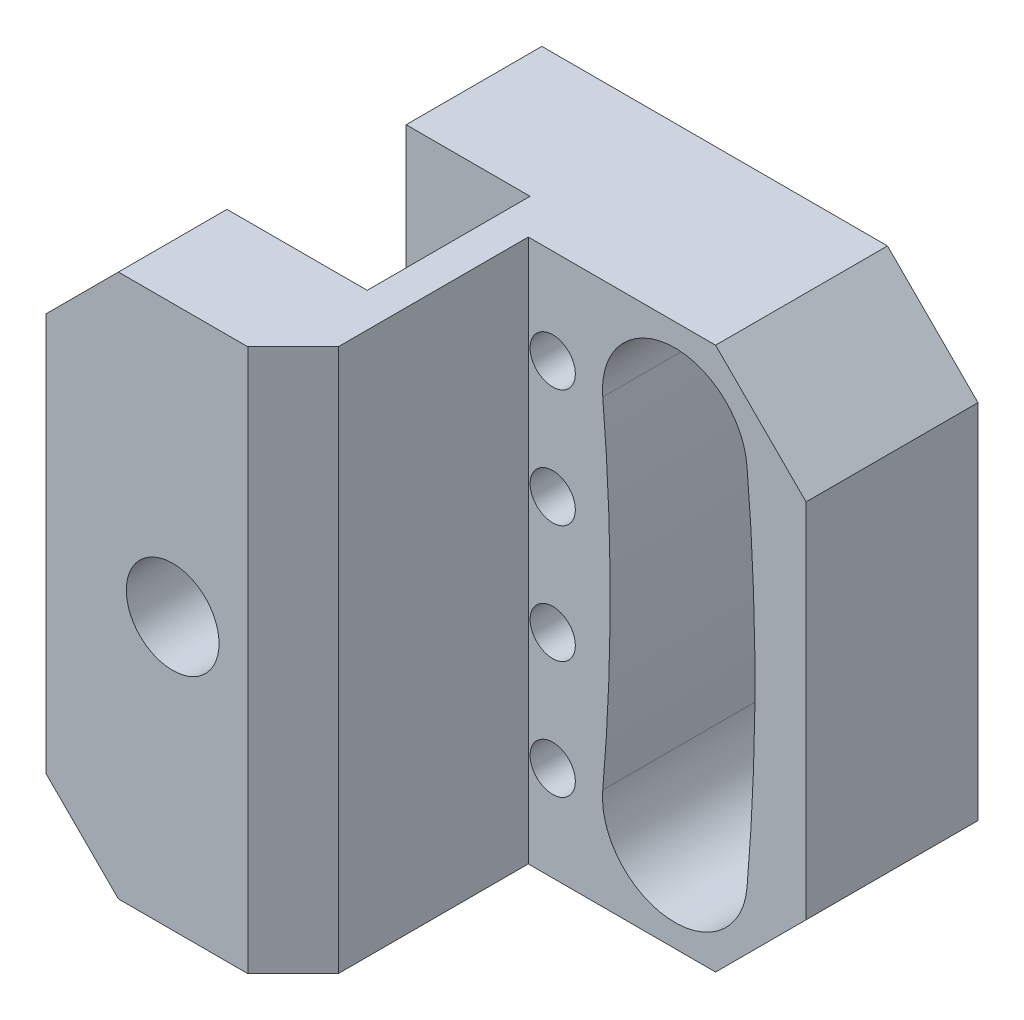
ISO-10303-21;
HEADER;
FILE_DESCRIPTION(('STEP AP214'),'2;1');
FILE_NAME('part.step','',(''),(''),'','','');
FILE_SCHEMA(('AUTOMOTIVE_DESIGN { 1 0 10303 214 1 1 1 1 }'));
ENDSEC;
DATA;
#1=APPLICATION_CONTEXT('core data for automotive mechanical design processes');
#2=APPLICATION_PROTOCOL_DEFINITION('international standard','automotive_design',2000,#1);
#3=PRODUCT_CONTEXT('',#1,'mechanical');
#4=PRODUCT('Part','Part','',(#3));
#5=PRODUCT_RELATED_PRODUCT_CATEGORY('part','',(#4));
#6=PRODUCT_DEFINITION_FORMATION('','',#4);
#7=PRODUCT_DEFINITION_CONTEXT('part definition',#1,'design');
#8=PRODUCT_DEFINITION('design','',#6,#7);
#9=PRODUCT_DEFINITION_SHAPE('','',#8);
#10=(LENGTH_UNIT() NAMED_UNIT(*) SI_UNIT(.MILLI.,.METRE.));
#11=(NAMED_UNIT(*) PLANE_ANGLE_UNIT() SI_UNIT($,.RADIAN.));
#12=(NAMED_UNIT(*) SI_UNIT($,.STERADIAN.) SOLID_ANGLE_UNIT());
#13=UNCERTAINTY_MEASURE_WITH_UNIT(LENGTH_MEASURE(1.E-05),#10,'distance_accuracy_value','');
#14=(GEOMETRIC_REPRESENTATION_CONTEXT(3) GLOBAL_UNCERTAINTY_ASSIGNED_CONTEXT((#13)) GLOBAL_UNIT_ASSIGNED_CONTEXT((#10,
#11,#12)) REPRESENTATION_CONTEXT('',''));
#15=CARTESIAN_POINT('',(0.,0.,0.));
#16=DIRECTION('',(0.,0.,1.));
#17=DIRECTION('',(1.,0.,0.));
#18=AXIS2_PLACEMENT_3D('',#15,#16,#17);
#19=CARTESIAN_POINT('',(0.,50.,45.));
#20=DIRECTION('',(1.,0.,0.));
#21=DIRECTION('',(0.,0.,-1.));
#22=AXIS2_PLACEMENT_3D('',#19,#20,#21);
#23=PLANE('',#22);
#24=DIRECTION('',(0.,0.,-1.));
#25=VECTOR('',#24,1.);
#26=CARTESIAN_POINT('',(0.,50.,45.));
#27=LINE('',#26,#25);
#28=CARTESIAN_POINT('',(0.,50.,43.));
#29=VERTEX_POINT('',#28);
#30=CARTESIAN_POINT('',(0.,50.0000000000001,33.));
#31=VERTEX_POINT('',#30);
#32=EDGE_CURVE('E710',#29,#31,#27,.T.);
#33=ORIENTED_EDGE('',*,*,#32,.T.);
#34=DIRECTION('',(0.,-1.,0.));
#35=VECTOR('',#34,1.);
#36=CARTESIAN_POINT('',(0.,60.0000000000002,33.));
#37=LINE('',#36,#35);
#38=CARTESIAN_POINT('',(0.,32.,33.));
#39=VERTEX_POINT('',#38);
#40=EDGE_CURVE('E358',#31,#39,#37,.T.);
#41=ORIENTED_EDGE('',*,*,#40,.T.);
#42=DIRECTION('',(0.,0.,1.));
#43=VECTOR('',#42,1.);
#44=CARTESIAN_POINT('',(0.,32.,0.));
#45=LINE('',#44,#43);
#46=CARTESIAN_POINT('',(0.,32.,43.));
#47=VERTEX_POINT('',#46);
#48=EDGE_CURVE('E570',#39,#47,#45,.T.);
#49=ORIENTED_EDGE('',*,*,#48,.T.);
#50=DIRECTION('',(0.,1.,0.));
#51=VECTOR('',#50,1.);
#52=CARTESIAN_POINT('',(0.,50.,43.));
#53=LINE('',#52,#51);
#54=EDGE_CURVE('E733',#47,#29,#53,.T.);
#55=ORIENTED_EDGE('',*,*,#54,.T.);
#56=EDGE_LOOP('',(#33,#41,#49,#55));
#57=FACE_BOUND('',#56,.T.);
#58=ADVANCED_FACE('F45',(#57),#23,.F.);
#59=CARTESIAN_POINT('',(2.,60.,45.));
#60=DIRECTION('',(-0.707106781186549,0.,0.707106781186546));
#61=DIRECTION('',(0.707106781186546,0.,0.707106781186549));
#62=AXIS2_PLACEMENT_3D('',#59,#60,#61);
#63=PLANE('',#62);
#64=DIRECTION('',(-0.577350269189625,0.577350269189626,-0.577350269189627));
#65=VECTOR('',#64,1.);
#66=CARTESIAN_POINT('',(-7.99999999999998,40.,35.));
#67=LINE('',#66,#65);
#68=CARTESIAN_POINT('',(2.,30.,45.));
#69=VERTEX_POINT('',#68);
#70=EDGE_CURVE('E748',#69,#47,#67,.T.);
#71=ORIENTED_EDGE('',*,*,#70,.F.);
#72=DIRECTION('',(0.,-1.,0.));
#73=VECTOR('',#72,1.);
#74=CARTESIAN_POINT('',(2.,10.,45.));
#75=LINE('',#74,#73);
#76=CARTESIAN_POINT('',(2.,52.,45.));
#77=VERTEX_POINT('',#76);
#78=EDGE_CURVE('E726',#77,#69,#75,.T.);
#79=ORIENTED_EDGE('',*,*,#78,.F.);
#80=DIRECTION('',(0.577350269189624,0.577350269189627,0.577350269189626));
#81=VECTOR('',#80,1.);
#82=CARTESIAN_POINT('',(4.66666666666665,54.6666666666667,47.6666666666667));
#83=LINE('',#82,#81);
#84=EDGE_CURVE('E738',#29,#77,#83,.T.);
#85=ORIENTED_EDGE('',*,*,#84,.F.);
#86=ORIENTED_EDGE('',*,*,#54,.F.);
#87=EDGE_LOOP('',(#71,#79,#85,#86));
#88=FACE_BOUND('',#87,.T.);
#89=ADVANCED_FACE('F792',(#88),#63,.T.);
#90=CARTESIAN_POINT('',(60.,60.,0.));
#91=DIRECTION('',(0.,0.,1.));
#92=DIRECTION('',(1.,0.,0.));
#93=AXIS2_PLACEMENT_3D('',#90,#91,#92);
#94=PLANE('',#93);
#95=CARTESIAN_POINT('',(-180.89,30.,0.));
#96=DIRECTION('',(0.,0.,-1.));
#97=DIRECTION('',(-1.,0.,0.));
#98=AXIS2_PLACEMENT_3D('',#95,#96,#97);
#99=CIRCLE('',#98,199.);
#100=CARTESIAN_POINT('',(16.342227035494,56.4659898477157,0.));
#101=VERTEX_POINT('',#100);
#102=CARTESIAN_POINT('',(16.342227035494,3.53401015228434,0.));
#103=VERTEX_POINT('',#102);
#104=EDGE_CURVE('E414',#101,#103,#99,.T.);
#105=ORIENTED_EDGE('',*,*,#104,.F.);
#106=CARTESIAN_POINT('',(14.3599935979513,56.2,0.));
#107=DIRECTION('',(0.,0.,-1.));
#108=DIRECTION('',(-1.,0.,0.));
#109=AXIS2_PLACEMENT_3D('',#106,#107,#108);
#110=CIRCLE('',#109,2.00000000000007);
#111=CARTESIAN_POINT('',(12.3777601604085,55.9340101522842,0.));
#112=VERTEX_POINT('',#111);
#113=EDGE_CURVE('E393',#112,#101,#110,.T.);
#114=ORIENTED_EDGE('',*,*,#113,.F.);
#115=CARTESIAN_POINT('',(-180.89,30.,0.));
#116=DIRECTION('',(0.,0.,1.));
#117=DIRECTION('',(-1.,0.,0.));
#118=AXIS2_PLACEMENT_3D('',#115,#116,#117);
#119=CIRCLE('',#118,195.);
#120=CARTESIAN_POINT('',(12.3777601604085,4.06598984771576,0.));
#121=VERTEX_POINT('',#120);
#122=EDGE_CURVE('E399',#121,#112,#119,.T.);
#123=ORIENTED_EDGE('',*,*,#122,.F.);
#124=CARTESIAN_POINT('',(14.3599935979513,3.80000000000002,0.));
#125=DIRECTION('',(0.,0.,-1.));
#126=DIRECTION('',(-1.,0.,0.));
#127=AXIS2_PLACEMENT_3D('',#124,#125,#126);
#128=CIRCLE('',#127,2.00000000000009);
#129=EDGE_CURVE('E418',#103,#121,#128,.T.);
#130=ORIENTED_EDGE('',*,*,#129,.F.);
#131=EDGE_LOOP('',(#105,#114,#123,#130));
#132=FACE_BOUND('',#131,.T.);
#133=CARTESIAN_POINT('',(-230.97,30.,0.));
#134=DIRECTION('',(0.,0.,1.));
#135=DIRECTION('',(-1.,0.,0.));
#136=AXIS2_PLACEMENT_3D('',#133,#134,#135);
#137=CIRCLE('',#136,251.);
#138=CARTESIAN_POINT('',(18.6804955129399,4.00711462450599,0.));
#139=VERTEX_POINT('',#138);
#140=CARTESIAN_POINT('',(18.6804955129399,55.9928853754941,0.));
#141=VERTEX_POINT('',#140);
#142=EDGE_CURVE('E458',#139,#141,#137,.T.);
#143=ORIENTED_EDGE('',*,*,#142,.F.);
#144=CARTESIAN_POINT('',(20.6697424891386,3.80000000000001,0.));
#145=DIRECTION('',(0.,0.,-1.));
#146=DIRECTION('',(-1.,0.,0.));
#147=AXIS2_PLACEMENT_3D('',#144,#145,#146);
#148=CIRCLE('',#147,2.);
#149=CARTESIAN_POINT('',(22.6589894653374,3.59288537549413,0.));
#150=VERTEX_POINT('',#149);
#151=EDGE_CURVE('E428',#150,#139,#148,.T.);
#152=ORIENTED_EDGE('',*,*,#151,.F.);
#153=CARTESIAN_POINT('',(-230.97,30.,0.));
#154=DIRECTION('',(0.,0.,-1.));
#155=DIRECTION('',(-1.,0.,0.));
#156=AXIS2_PLACEMENT_3D('',#153,#154,#155);
#157=CIRCLE('',#156,255.);
#158=CARTESIAN_POINT('',(22.6589894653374,56.407114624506,0.));
#159=VERTEX_POINT('',#158);
#160=EDGE_CURVE('E443',#159,#150,#157,.T.);
#161=ORIENTED_EDGE('',*,*,#160,.F.);
#162=CARTESIAN_POINT('',(20.6697424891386,56.2,0.));
#163=DIRECTION('',(0.,0.,-1.));
#164=DIRECTION('',(-1.,0.,0.));
#165=AXIS2_PLACEMENT_3D('',#162,#163,#164);
#166=CIRCLE('',#165,2.);
#167=EDGE_CURVE('E462',#141,#159,#166,.T.);
#168=ORIENTED_EDGE('',*,*,#167,.F.);
#169=EDGE_LOOP('',(#143,#152,#161,#168));
#170=FACE_BOUND('',#169,.T.);
#171=CARTESIAN_POINT('',(-288.78,30.,0.));
#172=DIRECTION('',(0.,0.,1.));
#173=DIRECTION('',(-1.,0.,0.));
#174=AXIS2_PLACEMENT_3D('',#171,#172,#173);
#175=CIRCLE('',#174,315.);
#176=CARTESIAN_POINT('',(25.1422744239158,3.96529968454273,0.));
#177=VERTEX_POINT('',#176);
#178=CARTESIAN_POINT('',(25.1422744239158,56.0347003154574,0.));
#179=VERTEX_POINT('',#178);
#180=EDGE_CURVE('E502',#177,#179,#175,.T.);
#181=ORIENTED_EDGE('',*,*,#180,.F.);
#182=CARTESIAN_POINT('',(27.1354317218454,3.80000000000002,0.));
#183=DIRECTION('',(0.,0.,-1.));
#184=DIRECTION('',(-1.,0.,0.));
#185=AXIS2_PLACEMENT_3D('',#182,#183,#184);
#186=CIRCLE('',#185,2.);
#187=CARTESIAN_POINT('',(29.1285890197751,3.63470031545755,0.));
#188=VERTEX_POINT('',#187);
#189=EDGE_CURVE('E472',#188,#177,#186,.T.);
#190=ORIENTED_EDGE('',*,*,#189,.F.);
#191=CARTESIAN_POINT('',(-288.78,30.,0.));
#192=DIRECTION('',(0.,0.,-1.));
#193=DIRECTION('',(-1.,0.,0.));
#194=AXIS2_PLACEMENT_3D('',#191,#192,#193);
#195=CIRCLE('',#194,319.);
#196=CARTESIAN_POINT('',(29.1285890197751,56.3652996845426,0.));
#197=VERTEX_POINT('',#196);
#198=EDGE_CURVE('E487',#197,#188,#195,.T.);
#199=ORIENTED_EDGE('',*,*,#198,.F.);
#200=CARTESIAN_POINT('',(27.1354317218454,56.2,0.));
#201=DIRECTION('',(0.,0.,-1.));
#202=DIRECTION('',(-1.,0.,0.));
#203=AXIS2_PLACEMENT_3D('',#200,#201,#202);
#204=CIRCLE('',#203,2.);
#205=EDGE_CURVE('E506',#179,#197,#204,.T.);
#206=ORIENTED_EDGE('',*,*,#205,.F.);
#207=EDGE_LOOP('',(#181,#190,#199,#206));
#208=FACE_BOUND('',#207,.T.);
#209=CARTESIAN_POINT('',(-393.4,30.,0.));
#210=DIRECTION('',(0.,0.,1.));
#211=DIRECTION('',(-1.,0.,0.));
#212=AXIS2_PLACEMENT_3D('',#209,#210,#211);
#213=CIRCLE('',#212,426.);
#214=CARTESIAN_POINT('',(31.8010822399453,3.92242990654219,0.));
#215=VERTEX_POINT('',#214);
#216=CARTESIAN_POINT('',(31.8010822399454,56.0775700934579,0.));
#217=VERTEX_POINT('',#216);
#218=EDGE_CURVE('E546',#215,#217,#213,.T.);
#219=ORIENTED_EDGE('',*,*,#218,.F.);
#220=CARTESIAN_POINT('',(33.7973314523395,3.79999999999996,0.));
#221=DIRECTION('',(0.,0.,-1.));
#222=DIRECTION('',(-1.,0.,0.));
#223=AXIS2_PLACEMENT_3D('',#220,#221,#222);
#224=CIRCLE('',#223,1.99999999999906);
#225=CARTESIAN_POINT('',(35.7935806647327,3.67757009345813,0.));
#226=VERTEX_POINT('',#225);
#227=EDGE_CURVE('E516',#226,#215,#224,.T.);
#228=ORIENTED_EDGE('',*,*,#227,.F.);
#229=CARTESIAN_POINT('',(-393.4,30.,0.));
#230=DIRECTION('',(0.,0.,-1.));
#231=DIRECTION('',(-1.,0.,0.));
#232=AXIS2_PLACEMENT_3D('',#229,#230,#231);
#233=CIRCLE('',#232,429.999999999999);
#234=CARTESIAN_POINT('',(35.7935806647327,56.322429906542,0.));
#235=VERTEX_POINT('',#234);
#236=EDGE_CURVE('E531',#235,#226,#233,.T.);
#237=ORIENTED_EDGE('',*,*,#236,.F.);
#238=CARTESIAN_POINT('',(33.7973314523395,56.2,0.));
#239=DIRECTION('',(0.,0.,-1.));
#240=DIRECTION('',(-1.,0.,0.));
#241=AXIS2_PLACEMENT_3D('',#238,#239,#240);
#242=CIRCLE('',#241,2.00000000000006);
#243=EDGE_CURVE('E550',#217,#235,#242,.T.);
#244=ORIENTED_EDGE('',*,*,#243,.F.);
#245=EDGE_LOOP('',(#219,#228,#237,#244));
#246=FACE_BOUND('',#245,.T.);
#247=DIRECTION('',(0.,1.,0.));
#248=VECTOR('',#247,1.);
#249=CARTESIAN_POINT('',(60.,0.,0.));
#250=LINE('',#249,#248);
#251=CARTESIAN_POINT('',(60.,9.99999999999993,0.));
#252=VERTEX_POINT('',#251);
#253=CARTESIAN_POINT('',(60.,50.,0.));
#254=VERTEX_POINT('',#253);
#255=EDGE_CURVE('E675',#252,#254,#250,.T.);
#256=ORIENTED_EDGE('',*,*,#255,.F.);
#257=DIRECTION('',(0.707106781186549,0.707106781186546,0.));
#258=VECTOR('',#257,1.);
#259=CARTESIAN_POINT('',(60.,9.99999999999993,0.));
#260=LINE('',#259,#258);
#261=CARTESIAN_POINT('',(50.,0.,0.));
#262=VERTEX_POINT('',#261);
#263=EDGE_CURVE('E68',#252,#262,#260,.F.);
#264=ORIENTED_EDGE('',*,*,#263,.T.);
#265=DIRECTION('',(1.,0.,0.));
#266=VECTOR('',#265,1.);
#267=CARTESIAN_POINT('',(10.0000000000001,0.,0.));
#268=LINE('',#267,#266);
#269=CARTESIAN_POINT('',(11.8,0.,0.));
#270=VERTEX_POINT('',#269);
#271=EDGE_CURVE('E680',#270,#262,#268,.T.);
#272=ORIENTED_EDGE('',*,*,#271,.F.);
#273=DIRECTION('',(0.,-1.,0.));
#274=VECTOR('',#273,1.);
#275=CARTESIAN_POINT('',(11.8000000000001,60.0000000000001,0.));
#276=LINE('',#275,#274);
#277=CARTESIAN_POINT('',(11.8000000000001,60.0000000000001,0.));
#278=VERTEX_POINT('',#277);
#279=EDGE_CURVE('E376',#278,#270,#276,.T.);
#280=ORIENTED_EDGE('',*,*,#279,.F.);
#281=DIRECTION('',(-1.,0.,0.));
#282=VECTOR('',#281,1.);
#283=CARTESIAN_POINT('',(50.,60.,0.));
#284=LINE('',#283,#282);
#285=CARTESIAN_POINT('',(50.,60.,0.));
#286=VERTEX_POINT('',#285);
#287=EDGE_CURVE('E698',#286,#278,#284,.T.);
#288=ORIENTED_EDGE('',*,*,#287,.F.);
#289=DIRECTION('',(-0.707106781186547,0.707106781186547,0.));
#290=VECTOR('',#289,1.);
#291=CARTESIAN_POINT('',(50.,60.,0.));
#292=LINE('',#291,#290);
#293=EDGE_CURVE('E694',#254,#286,#292,.T.);
#294=ORIENTED_EDGE('',*,*,#293,.F.);
#295=EDGE_LOOP('',(#256,#264,#272,#280,#288,#294));
#296=FACE_BOUND('',#295,.T.);
#297=CARTESIAN_POINT('',(-178.653407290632,30.,0.));
#298=DIRECTION('',(0.,0.,-1.));
#299=DIRECTION('',(-1.,0.,0.));
#300=AXIS2_PLACEMENT_3D('',#297,#298,#299);
#301=CIRCLE('',#300,233.);
#302=CARTESIAN_POINT('',(53.4698989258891,50.1933333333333,0.));
#303=VERTEX_POINT('',#302);
#304=CARTESIAN_POINT('',(53.4698989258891,9.80666666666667,0.));
#305=VERTEX_POINT('',#304);
#306=EDGE_CURVE('E627',#303,#305,#301,.T.);
#307=ORIENTED_EDGE('',*,*,#306,.F.);
#308=CARTESIAN_POINT('',(45.5,49.5,0.));
#309=DIRECTION('',(0.,0.,-1.));
#310=DIRECTION('',(-1.,0.,0.));
#311=AXIS2_PLACEMENT_3D('',#308,#309,#310);
#312=CIRCLE('',#311,8.00000000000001);
#313=CARTESIAN_POINT('',(37.5301010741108,48.8066666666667,0.));
#314=VERTEX_POINT('',#313);
#315=EDGE_CURVE('E623',#314,#303,#312,.T.);
#316=ORIENTED_EDGE('',*,*,#315,.F.);
#317=CARTESIAN_POINT('',(-178.653407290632,30.,0.));
#318=DIRECTION('',(0.,0.,1.));
#319=DIRECTION('',(-1.,0.,0.));
#320=AXIS2_PLACEMENT_3D('',#317,#318,#319);
#321=CIRCLE('',#320,217.);
#322=CARTESIAN_POINT('',(37.5301010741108,11.1933333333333,0.));
#323=VERTEX_POINT('',#322);
#324=EDGE_CURVE('E619',#323,#314,#321,.T.);
#325=ORIENTED_EDGE('',*,*,#324,.F.);
#326=CARTESIAN_POINT('',(45.5,10.5,0.));
#327=DIRECTION('',(0.,0.,-1.));
#328=DIRECTION('',(-1.,0.,0.));
#329=AXIS2_PLACEMENT_3D('',#326,#327,#328);
#330=CIRCLE('',#329,8.00000000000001);
#331=EDGE_CURVE('E631',#305,#323,#330,.T.);
#332=ORIENTED_EDGE('',*,*,#331,.F.);
#333=EDGE_LOOP('',(#307,#316,#325,#332));
#334=FACE_BOUND('',#333,.T.);
#335=ADVANCED_FACE('F823',(#132,#170,#208,#246,#296,#334),#94,.F.);
#336=CARTESIAN_POINT('',(29.2999999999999,60.0000000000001,19.));
#337=DIRECTION('',(0.,0.,-1.));
#338=DIRECTION('',(-1.,0.,0.));
#339=AXIS2_PLACEMENT_3D('',#336,#337,#338);
#340=PLANE('',#339);
#341=CARTESIAN_POINT('',(32.,49.5,19.));
#342=DIRECTION('',(0.,0.,-1.));
#343=DIRECTION('',(-1.,0.,0.));
#344=AXIS2_PLACEMENT_3D('',#341,#342,#343);
#345=CIRCLE('',#344,2.49999999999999);
#346=CARTESIAN_POINT('',(29.5,49.5,19.));
#347=VERTEX_POINT('',#346);
#348=EDGE_CURVE('E582',#347,#347,#345,.T.);
#349=ORIENTED_EDGE('',*,*,#348,.T.);
#350=EDGE_LOOP('',(#349));
#351=FACE_BOUND('',#350,.T.);
#352=CARTESIAN_POINT('',(32.,36.5,19.));
#353=DIRECTION('',(0.,0.,-1.));
#354=DIRECTION('',(-1.,0.,0.));
#355=AXIS2_PLACEMENT_3D('',#352,#353,#354);
#356=CIRCLE('',#355,2.49999999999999);
#357=CARTESIAN_POINT('',(29.5,36.5,19.));
#358=VERTEX_POINT('',#357);
#359=EDGE_CURVE('E587',#358,#358,#356,.T.);
#360=ORIENTED_EDGE('',*,*,#359,.T.);
#361=EDGE_LOOP('',(#360));
#362=FACE_BOUND('',#361,.T.);
#363=CARTESIAN_POINT('',(32.,23.5,19.));
#364=DIRECTION('',(0.,0.,-1.));
#365=DIRECTION('',(-1.,0.,0.));
#366=AXIS2_PLACEMENT_3D('',#363,#364,#365);
#367=CIRCLE('',#366,2.49999999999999);
#368=CARTESIAN_POINT('',(29.5,23.5,19.));
#369=VERTEX_POINT('',#368);
#370=EDGE_CURVE('E595',#369,#369,#367,.T.);
#371=ORIENTED_EDGE('',*,*,#370,.T.);
#372=EDGE_LOOP('',(#371));
#373=FACE_BOUND('',#372,.T.);
#374=CARTESIAN_POINT('',(32.,10.5,19.));
#375=DIRECTION('',(0.,0.,-1.));
#376=DIRECTION('',(-1.,0.,0.));
#377=AXIS2_PLACEMENT_3D('',#374,#375,#376);
#378=CIRCLE('',#377,2.49999999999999);
#379=CARTESIAN_POINT('',(29.5,10.5,19.));
#380=VERTEX_POINT('',#379);
#381=EDGE_CURVE('E603',#380,#380,#378,.T.);
#382=ORIENTED_EDGE('',*,*,#381,.T.);
#383=EDGE_LOOP('',(#382));
#384=FACE_BOUND('',#383,.T.);
#385=DIRECTION('',(1.,0.,0.));
#386=VECTOR('',#385,1.);
#387=CARTESIAN_POINT('',(29.3,0.,19.));
#388=LINE('',#387,#386);
#389=CARTESIAN_POINT('',(29.3,0.,19.));
#390=VERTEX_POINT('',#389);
#391=CARTESIAN_POINT('',(50.,0.,19.));
#392=VERTEX_POINT('',#391);
#393=EDGE_CURVE('E655',#390,#392,#388,.T.);
#394=ORIENTED_EDGE('',*,*,#393,.T.);
#395=DIRECTION('',(-0.707106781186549,-0.707106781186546,0.));
#396=VECTOR('',#395,1.);
#397=CARTESIAN_POINT('',(60.,9.99999999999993,19.));
#398=LINE('',#397,#396);
#399=CARTESIAN_POINT('',(60.,9.99999999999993,19.));
#400=VERTEX_POINT('',#399);
#401=EDGE_CURVE('E11',#392,#400,#398,.F.);
#402=ORIENTED_EDGE('',*,*,#401,.T.);
#403=DIRECTION('',(0.,-1.,0.));
#404=VECTOR('',#403,1.);
#405=CARTESIAN_POINT('',(59.9999999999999,60.0000000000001,19.));
#406=LINE('',#405,#404);
#407=CARTESIAN_POINT('',(59.9999999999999,50.0000000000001,19.));
#408=VERTEX_POINT('',#407);
#409=EDGE_CURVE('E664',#408,#400,#406,.T.);
#410=ORIENTED_EDGE('',*,*,#409,.F.);
#411=DIRECTION('',(0.707106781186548,-0.707106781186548,0.));
#412=VECTOR('',#411,1.);
#413=CARTESIAN_POINT('',(50.,60.,19.));
#414=LINE('',#413,#412);
#415=CARTESIAN_POINT('',(50.,60.0000000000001,19.));
#416=VERTEX_POINT('',#415);
#417=EDGE_CURVE('E668',#416,#408,#414,.T.);
#418=ORIENTED_EDGE('',*,*,#417,.F.);
#419=DIRECTION('',(1.,0.,0.));
#420=VECTOR('',#419,1.);
#421=CARTESIAN_POINT('',(29.2999999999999,60.0000000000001,19.));
#422=LINE('',#421,#420);
#423=CARTESIAN_POINT('',(29.2999999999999,60.0000000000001,19.));
#424=VERTEX_POINT('',#423);
#425=EDGE_CURVE('E654',#424,#416,#422,.T.);
#426=ORIENTED_EDGE('',*,*,#425,.F.);
#427=DIRECTION('',(0.,-1.,0.));
#428=VECTOR('',#427,1.);
#429=CARTESIAN_POINT('',(29.2999999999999,60.0000000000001,19.));
#430=LINE('',#429,#428);
#431=EDGE_CURVE('E659',#424,#390,#430,.T.);
#432=ORIENTED_EDGE('',*,*,#431,.T.);
#433=EDGE_LOOP('',(#394,#402,#410,#418,#426,#432));
#434=FACE_BOUND('',#433,.T.);
#435=CARTESIAN_POINT('',(-178.653407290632,30.,19.));
#436=DIRECTION('',(0.,0.,-1.));
#437=DIRECTION('',(-1.,0.,0.));
#438=AXIS2_PLACEMENT_3D('',#435,#436,#437);
#439=CIRCLE('',#438,217.);
#440=CARTESIAN_POINT('',(37.5301010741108,48.8066666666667,19.));
#441=VERTEX_POINT('',#440);
#442=CARTESIAN_POINT('',(37.5301010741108,11.1933333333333,19.));
#443=VERTEX_POINT('',#442);
#444=EDGE_CURVE('E615',#441,#443,#439,.T.);
#445=ORIENTED_EDGE('',*,*,#444,.F.);
#446=CARTESIAN_POINT('',(45.5,49.5,19.));
#447=DIRECTION('',(0.,0.,-1.));
#448=DIRECTION('',(-1.,0.,0.));
#449=AXIS2_PLACEMENT_3D('',#446,#447,#448);
#450=CIRCLE('',#449,8.00000000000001);
#451=CARTESIAN_POINT('',(53.4698989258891,50.1933333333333,19.));
#452=VERTEX_POINT('',#451);
#453=EDGE_CURVE('E639',#452,#441,#450,.F.);
#454=ORIENTED_EDGE('',*,*,#453,.F.);
#455=CARTESIAN_POINT('',(-178.653407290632,30.,19.));
#456=DIRECTION('',(0.,0.,-1.));
#457=DIRECTION('',(-1.,0.,0.));
#458=AXIS2_PLACEMENT_3D('',#455,#456,#457);
#459=CIRCLE('',#458,233.);
#460=CARTESIAN_POINT('',(53.4698989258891,9.80666666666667,19.));
#461=VERTEX_POINT('',#460);
#462=EDGE_CURVE('E607',#461,#452,#459,.F.);
#463=ORIENTED_EDGE('',*,*,#462,.F.);
#464=CARTESIAN_POINT('',(45.5,10.5,19.));
#465=DIRECTION('',(0.,0.,-1.));
#466=DIRECTION('',(-1.,0.,0.));
#467=AXIS2_PLACEMENT_3D('',#464,#465,#466);
#468=CIRCLE('',#467,8.00000000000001);
#469=EDGE_CURVE('E611',#443,#461,#468,.F.);
#470=ORIENTED_EDGE('',*,*,#469,.F.);
#471=EDGE_LOOP('',(#445,#454,#463,#470));
#472=FACE_BOUND('',#471,.T.);
#473=ADVANCED_FACE('F814',(#351,#362,#373,#384,#434,#472),#340,.F.);
#474=CARTESIAN_POINT('',(60.,0.,45.));
#475=DIRECTION('',(-1.,0.,0.));
#476=DIRECTION('',(0.,-1.,0.));
#477=AXIS2_PLACEMENT_3D('',#474,#475,#476);
#478=PLANE('',#477);
#479=ORIENTED_EDGE('',*,*,#409,.T.);
#480=DIRECTION('',(0.,0.,-1.));
#481=VECTOR('',#480,1.);
#482=CARTESIAN_POINT('',(60.,9.99999999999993,45.));
#483=LINE('',#482,#481);
#484=EDGE_CURVE('E769',#400,#252,#483,.T.);
#485=ORIENTED_EDGE('',*,*,#484,.T.);
#486=ORIENTED_EDGE('',*,*,#255,.T.);
#487=DIRECTION('',(0.,0.,-1.));
#488=VECTOR('',#487,1.);
#489=CARTESIAN_POINT('',(60.,50.,45.));
#490=LINE('',#489,#488);
#491=EDGE_CURVE('E721',#408,#254,#490,.T.);
#492=ORIENTED_EDGE('',*,*,#491,.F.);
#493=EDGE_LOOP('',(#479,#485,#486,#492));
#494=FACE_BOUND('',#493,.T.);
#495=ADVANCED_FACE('F875',(#494),#478,.F.);
#496=CARTESIAN_POINT('',(50.,60.,45.));
#497=DIRECTION('',(-0.707106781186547,-0.707106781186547,0.));
#498=DIRECTION('',(0.707106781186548,-0.707106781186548,0.));
#499=AXIS2_PLACEMENT_3D('',#496,#497,#498);
#500=PLANE('',#499);
#501=DIRECTION('',(0.,0.,-1.));
#502=VECTOR('',#501,1.);
#503=CARTESIAN_POINT('',(50.,60.,45.));
#504=LINE('',#503,#502);
#505=EDGE_CURVE('E718',#416,#286,#504,.T.);
#506=ORIENTED_EDGE('',*,*,#505,.F.);
#507=ORIENTED_EDGE('',*,*,#417,.T.);
#508=ORIENTED_EDGE('',*,*,#491,.T.);
#509=ORIENTED_EDGE('',*,*,#293,.T.);
#510=EDGE_LOOP('',(#506,#507,#508,#509));
#511=FACE_BOUND('',#510,.T.);
#512=ADVANCED_FACE('F818',(#511),#500,.F.);
#513=CARTESIAN_POINT('',(50.,60.,45.));
#514=DIRECTION('',(0.,-1.,0.));
#515=DIRECTION('',(1.,0.,0.));
#516=AXIS2_PLACEMENT_3D('',#513,#514,#515);
#517=PLANE('',#516);
#518=DIRECTION('',(0.,0.,1.));
#519=VECTOR('',#518,1.);
#520=CARTESIAN_POINT('',(25.5000000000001,60.0000000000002,15.));
#521=LINE('',#520,#519);
#522=CARTESIAN_POINT('',(25.5000000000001,60.0000000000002,15.));
#523=VERTEX_POINT('',#522);
#524=CARTESIAN_POINT('',(25.5000000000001,60.0000000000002,33.));
#525=VERTEX_POINT('',#524);
#526=EDGE_CURVE('E327',#523,#525,#521,.T.);
#527=ORIENTED_EDGE('',*,*,#526,.T.);
#528=DIRECTION('',(-1.,0.,0.));
#529=VECTOR('',#528,1.);
#530=CARTESIAN_POINT('',(0.,60.0000000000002,33.));
#531=LINE('',#530,#529);
#532=CARTESIAN_POINT('',(10.0000000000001,60.0000000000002,33.));
#533=VERTEX_POINT('',#532);
#534=EDGE_CURVE('E324',#525,#533,#531,.T.);
#535=ORIENTED_EDGE('',*,*,#534,.T.);
#536=DIRECTION('',(0.,0.,-1.));
#537=VECTOR('',#536,1.);
#538=CARTESIAN_POINT('',(9.99999999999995,60.,45.));
#539=LINE('',#538,#537);
#540=CARTESIAN_POINT('',(9.99999999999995,60.,45.));
#541=VERTEX_POINT('',#540);
#542=EDGE_CURVE('E714',#541,#533,#539,.T.);
#543=ORIENTED_EDGE('',*,*,#542,.F.);
#544=DIRECTION('',(-1.,0.,0.));
#545=VECTOR('',#544,1.);
#546=CARTESIAN_POINT('',(50.,60.,45.));
#547=LINE('',#546,#545);
#548=CARTESIAN_POINT('',(24.2999999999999,60.,45.));
#549=VERTEX_POINT('',#548);
#550=EDGE_CURVE('E676',#549,#541,#547,.T.);
#551=ORIENTED_EDGE('',*,*,#550,.F.);
#552=DIRECTION('',(0.707106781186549,0.,-0.707106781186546));
#553=VECTOR('',#552,1.);
#554=CARTESIAN_POINT('',(29.2999999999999,60.,40.));
#555=LINE('',#554,#553);
#556=CARTESIAN_POINT('',(29.2999999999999,60.0000000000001,40.));
#557=VERTEX_POINT('',#556);
#558=EDGE_CURVE('E762',#549,#557,#555,.T.);
#559=ORIENTED_EDGE('',*,*,#558,.T.);
#560=DIRECTION('',(0.,0.,-1.));
#561=VECTOR('',#560,1.);
#562=CARTESIAN_POINT('',(29.2999999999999,60.0000000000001,38.8));
#563=LINE('',#562,#561);
#564=EDGE_CURVE('E651',#557,#424,#563,.T.);
#565=ORIENTED_EDGE('',*,*,#564,.T.);
#566=ORIENTED_EDGE('',*,*,#425,.T.);
#567=ORIENTED_EDGE('',*,*,#505,.T.);
#568=ORIENTED_EDGE('',*,*,#287,.T.);
#569=DIRECTION('',(0.,0.,1.));
#570=VECTOR('',#569,1.);
#571=CARTESIAN_POINT('',(11.8000000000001,60.0000000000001,0.));
#572=LINE('',#571,#570);
#573=CARTESIAN_POINT('',(11.8000000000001,60.0000000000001,15.));
#574=VERTEX_POINT('',#573);
#575=EDGE_CURVE('E337',#278,#574,#572,.T.);
#576=ORIENTED_EDGE('',*,*,#575,.T.);
#577=DIRECTION('',(1.,0.,0.));
#578=VECTOR('',#577,1.);
#579=CARTESIAN_POINT('',(0.,60.0000000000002,15.));
#580=LINE('',#579,#578);
#581=EDGE_CURVE('E315',#574,#523,#580,.T.);
#582=ORIENTED_EDGE('',*,*,#581,.T.);
#583=EDGE_LOOP('',(#527,#535,#543,#551,#559,#565,#566,#567,#568,#576,#582));
#584=FACE_BOUND('',#583,.T.);
#585=ADVANCED_FACE('F335',(#584),#517,.F.);
#586=CARTESIAN_POINT('',(0.,50.,45.));
#587=DIRECTION('',(0.707106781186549,-0.707106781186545,0.));
#588=DIRECTION('',(0.707106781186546,0.70710678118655,0.));
#589=AXIS2_PLACEMENT_3D('',#586,#587,#588);
#590=PLANE('',#589);
#591=ORIENTED_EDGE('',*,*,#542,.T.);
#592=DIRECTION('',(-0.707106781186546,-0.70710678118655,0.));
#593=VECTOR('',#592,1.);
#594=CARTESIAN_POINT('',(0.,50.,33.));
#595=LINE('',#594,#593);
#596=EDGE_CURVE('E369',#533,#31,#595,.T.);
#597=ORIENTED_EDGE('',*,*,#596,.T.);
#598=ORIENTED_EDGE('',*,*,#32,.F.);
#599=ORIENTED_EDGE('',*,*,#84,.T.);
#600=DIRECTION('',(-0.707106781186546,-0.70710678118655,0.));
#601=VECTOR('',#600,1.);
#602=CARTESIAN_POINT('',(0.,50.,45.));
#603=LINE('',#602,#601);
#604=EDGE_CURVE('E679',#541,#77,#603,.T.);
#605=ORIENTED_EDGE('',*,*,#604,.F.);
#606=EDGE_LOOP('',(#591,#597,#598,#599,#605));
#607=FACE_BOUND('',#606,.T.);
#608=ADVANCED_FACE('F794',(#607),#590,.F.);
#609=DIRECTION('',(0.,0.,1.));
#610=VECTOR('',#609,1.);
#611=CARTESIAN_POINT('',(0.,28.,0.));
#612=LINE('',#611,#610);
#613=CARTESIAN_POINT('',(0.,28.,33.));
#614=VERTEX_POINT('',#613);
#615=CARTESIAN_POINT('',(0.,28.,43.));
#616=VERTEX_POINT('',#615);
#617=EDGE_CURVE('E560',#614,#616,#612,.T.);
#618=ORIENTED_EDGE('',*,*,#617,.F.);
#619=CARTESIAN_POINT('',(0.,9.99999999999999,33.));
#620=VERTEX_POINT('',#619);
#621=EDGE_CURVE('E354',#614,#620,#37,.T.);
#622=ORIENTED_EDGE('',*,*,#621,.T.);
#623=DIRECTION('',(0.,0.,-1.));
#624=VECTOR('',#623,1.);
#625=CARTESIAN_POINT('',(0.,10.,45.));
#626=LINE('',#625,#624);
#627=CARTESIAN_POINT('',(0.,10.,43.));
#628=VERTEX_POINT('',#627);
#629=EDGE_CURVE('E706',#628,#620,#626,.T.);
#630=ORIENTED_EDGE('',*,*,#629,.F.);
#631=EDGE_CURVE('E734',#628,#616,#53,.T.);
#632=ORIENTED_EDGE('',*,*,#631,.T.);
#633=EDGE_LOOP('',(#618,#622,#630,#632));
#634=FACE_BOUND('',#633,.T.);
#635=ADVANCED_FACE('F839',(#634),#23,.F.);
#636=CARTESIAN_POINT('',(0.,10.,45.));
#637=DIRECTION('',(0.707106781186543,0.707106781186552,0.));
#638=DIRECTION('',(-0.707106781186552,0.707106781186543,0.));
#639=AXIS2_PLACEMENT_3D('',#636,#637,#638);
#640=PLANE('',#639);
#641=ORIENTED_EDGE('',*,*,#629,.T.);
#642=DIRECTION('',(0.707106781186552,-0.707106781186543,0.));
#643=VECTOR('',#642,1.);
#644=CARTESIAN_POINT('',(0.,10.,33.));
#645=LINE('',#644,#643);
#646=CARTESIAN_POINT('',(10.0000000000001,0.,33.));
#647=VERTEX_POINT('',#646);
#648=EDGE_CURVE('E365',#620,#647,#645,.T.);
#649=ORIENTED_EDGE('',*,*,#648,.T.);
#650=DIRECTION('',(0.,0.,-1.));
#651=VECTOR('',#650,1.);
#652=CARTESIAN_POINT('',(10.0000000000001,0.,45.));
#653=LINE('',#652,#651);
#654=CARTESIAN_POINT('',(10.0000000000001,0.,45.));
#655=VERTEX_POINT('',#654);
#656=EDGE_CURVE('E691',#655,#647,#653,.T.);
#657=ORIENTED_EDGE('',*,*,#656,.F.);
#658=DIRECTION('',(0.707106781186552,-0.707106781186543,0.));
#659=VECTOR('',#658,1.);
#660=CARTESIAN_POINT('',(0.,10.,45.));
#661=LINE('',#660,#659);
#662=CARTESIAN_POINT('',(2.,8.00000000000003,45.));
#663=VERTEX_POINT('',#662);
#664=EDGE_CURVE('E684',#663,#655,#661,.T.);
#665=ORIENTED_EDGE('',*,*,#664,.F.);
#666=DIRECTION('',(-0.577350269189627,0.577350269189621,-0.577350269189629));
#667=VECTOR('',#666,1.);
#668=CARTESIAN_POINT('',(-15.3333333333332,25.333333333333,27.6666666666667));
#669=LINE('',#668,#667);
#670=EDGE_CURVE('E730',#663,#628,#669,.T.);
#671=ORIENTED_EDGE('',*,*,#670,.T.);
#672=EDGE_LOOP('',(#641,#649,#657,#665,#671));
#673=FACE_BOUND('',#672,.T.);
#674=ADVANCED_FACE('F832',(#673),#640,.F.);
#675=CARTESIAN_POINT('',(10.0000000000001,0.,45.));
#676=DIRECTION('',(0.,1.,0.));
#677=DIRECTION('',(-1.,0.,0.));
#678=AXIS2_PLACEMENT_3D('',#675,#676,#677);
#679=PLANE('',#678);
#680=CARTESIAN_POINT('',(15.9999999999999,0.,38.5));
#681=DIRECTION('',(0.,-1.,0.));
#682=DIRECTION('',(0.,0.,-1.));
#683=AXIS2_PLACEMENT_3D('',#680,#681,#682);
#684=CIRCLE('',#683,2.1);
#685=CARTESIAN_POINT('',(15.9999999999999,0.,36.4));
#686=VERTEX_POINT('',#685);
#687=EDGE_CURVE('E389',#686,#686,#684,.T.);
#688=ORIENTED_EDGE('',*,*,#687,.F.);
#689=EDGE_LOOP('',(#688));
#690=FACE_BOUND('',#689,.T.);
#691=ORIENTED_EDGE('',*,*,#271,.T.);
#692=DIRECTION('',(0.,0.,1.));
#693=VECTOR('',#692,1.);
#694=CARTESIAN_POINT('',(50.,0.,45.));
#695=LINE('',#694,#693);
#696=EDGE_CURVE('E54',#262,#392,#695,.T.);
#697=ORIENTED_EDGE('',*,*,#696,.T.);
#698=ORIENTED_EDGE('',*,*,#393,.F.);
#699=DIRECTION('',(0.,0.,-1.));
#700=VECTOR('',#699,1.);
#701=CARTESIAN_POINT('',(29.3,0.,38.8));
#702=LINE('',#701,#700);
#703=CARTESIAN_POINT('',(29.3,0.,40.));
#704=VERTEX_POINT('',#703);
#705=EDGE_CURVE('E650',#704,#390,#702,.T.);
#706=ORIENTED_EDGE('',*,*,#705,.F.);
#707=DIRECTION('',(-0.707106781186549,0.,0.707106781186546));
#708=VECTOR('',#707,1.);
#709=CARTESIAN_POINT('',(29.2999999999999,0.,40.));
#710=LINE('',#709,#708);
#711=CARTESIAN_POINT('',(24.3,0.,45.));
#712=VERTEX_POINT('',#711);
#713=EDGE_CURVE('E756',#704,#712,#710,.T.);
#714=ORIENTED_EDGE('',*,*,#713,.T.);
#715=DIRECTION('',(1.,0.,0.));
#716=VECTOR('',#715,1.);
#717=CARTESIAN_POINT('',(10.0000000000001,0.,45.));
#718=LINE('',#717,#716);
#719=EDGE_CURVE('E687',#655,#712,#718,.T.);
#720=ORIENTED_EDGE('',*,*,#719,.F.);
#721=ORIENTED_EDGE('',*,*,#656,.T.);
#722=DIRECTION('',(-1.,0.,0.));
#723=VECTOR('',#722,1.);
#724=CARTESIAN_POINT('',(0.,0.,33.));
#725=LINE('',#724,#723);
#726=CARTESIAN_POINT('',(25.5,0.,33.));
#727=VERTEX_POINT('',#726);
#728=EDGE_CURVE('E339',#727,#647,#725,.T.);
#729=ORIENTED_EDGE('',*,*,#728,.F.);
#730=DIRECTION('',(0.,0.,1.));
#731=VECTOR('',#730,1.);
#732=CARTESIAN_POINT('',(25.5,0.,15.));
#733=LINE('',#732,#731);
#734=CARTESIAN_POINT('',(25.5,0.,15.));
#735=VERTEX_POINT('',#734);
#736=EDGE_CURVE('E342',#735,#727,#733,.T.);
#737=ORIENTED_EDGE('',*,*,#736,.F.);
#738=DIRECTION('',(1.,0.,0.));
#739=VECTOR('',#738,1.);
#740=CARTESIAN_POINT('',(0.,0.,15.));
#741=LINE('',#740,#739);
#742=CARTESIAN_POINT('',(11.8,0.,15.));
#743=VERTEX_POINT('',#742);
#744=EDGE_CURVE('E318',#743,#735,#741,.T.);
#745=ORIENTED_EDGE('',*,*,#744,.F.);
#746=DIRECTION('',(0.,0.,1.));
#747=VECTOR('',#746,1.);
#748=CARTESIAN_POINT('',(11.8,0.,0.));
#749=LINE('',#748,#747);
#750=EDGE_CURVE('E373',#270,#743,#749,.T.);
#751=ORIENTED_EDGE('',*,*,#750,.F.);
#752=EDGE_LOOP('',(#691,#697,#698,#706,#714,#720,#721,#729,#737,#745,#751));
#753=FACE_BOUND('',#752,.T.);
#754=ADVANCED_FACE('F828',(#690,#753),#679,.F.);
#755=CARTESIAN_POINT('',(60.,60.,45.));
#756=DIRECTION('',(0.,0.,1.));
#757=DIRECTION('',(1.,0.,0.));
#758=AXIS2_PLACEMENT_3D('',#755,#756,#757);
#759=PLANE('',#758);
#760=CARTESIAN_POINT('',(16.,30.,45.));
#761=DIRECTION('',(0.,0.,1.));
#762=DIRECTION('',(1.,0.,0.));
#763=AXIS2_PLACEMENT_3D('',#760,#761,#762);
#764=CIRCLE('',#763,5.125);
#765=CARTESIAN_POINT('',(21.125,30.,45.));
#766=VERTEX_POINT('',#765);
#767=EDGE_CURVE('E1445',#766,#766,#764,.T.);
#768=ORIENTED_EDGE('',*,*,#767,.F.);
#769=EDGE_LOOP('',(#768));
#770=FACE_BOUND('',#769,.T.);
#771=ORIENTED_EDGE('',*,*,#719,.T.);
#772=DIRECTION('',(0.,1.,0.));
#773=VECTOR('',#772,1.);
#774=CARTESIAN_POINT('',(24.2999999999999,60.0000000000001,45.));
#775=LINE('',#774,#773);
#776=EDGE_CURVE('E759',#712,#549,#775,.T.);
#777=ORIENTED_EDGE('',*,*,#776,.T.);
#778=ORIENTED_EDGE('',*,*,#550,.T.);
#779=ORIENTED_EDGE('',*,*,#604,.T.);
#780=ORIENTED_EDGE('',*,*,#78,.T.);
#781=EDGE_CURVE('E725',#69,#663,#75,.T.);
#782=ORIENTED_EDGE('',*,*,#781,.T.);
#783=ORIENTED_EDGE('',*,*,#664,.T.);
#784=EDGE_LOOP('',(#771,#777,#778,#779,#780,#782,#783));
#785=FACE_BOUND('',#784,.T.);
#786=ADVANCED_FACE('F801',(#770,#785),#759,.T.);
#787=CARTESIAN_POINT('',(29.2999999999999,60.0000000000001,38.8));
#788=DIRECTION('',(-1.,0.,0.));
#789=DIRECTION('',(0.,-1.,0.));
#790=AXIS2_PLACEMENT_3D('',#787,#788,#789);
#791=PLANE('',#790);
#792=ORIENTED_EDGE('',*,*,#564,.F.);
#793=DIRECTION('',(0.,-1.,0.));
#794=VECTOR('',#793,1.);
#795=CARTESIAN_POINT('',(29.3,0.,40.));
#796=LINE('',#795,#794);
#797=EDGE_CURVE('E752',#557,#704,#796,.T.);
#798=ORIENTED_EDGE('',*,*,#797,.T.);
#799=ORIENTED_EDGE('',*,*,#705,.T.);
#800=ORIENTED_EDGE('',*,*,#431,.F.);
#801=EDGE_LOOP('',(#792,#798,#799,#800));
#802=FACE_BOUND('',#801,.T.);
#803=ADVANCED_FACE('F810',(#802),#791,.F.);
#804=CARTESIAN_POINT('',(45.5,49.5,45.001));
#805=DIRECTION('',(0.,0.,-1.));
#806=DIRECTION('',(-1.,0.,0.));
#807=AXIS2_PLACEMENT_3D('',#804,#805,#806);
#808=CYLINDRICAL_SURFACE('',#807,8.00000000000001);
#809=ORIENTED_EDGE('',*,*,#453,.T.);
#810=DIRECTION('',(0.,0.,-1.));
#811=VECTOR('',#810,1.);
#812=CARTESIAN_POINT('',(37.5301010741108,48.8066666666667,45.001));
#813=LINE('',#812,#811);
#814=EDGE_CURVE('E634',#441,#314,#813,.T.);
#815=ORIENTED_EDGE('',*,*,#814,.T.);
#816=ORIENTED_EDGE('',*,*,#315,.T.);
#817=DIRECTION('',(0.,0.,-1.));
#818=VECTOR('',#817,1.);
#819=CARTESIAN_POINT('',(53.4698989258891,50.1933333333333,45.001));
#820=LINE('',#819,#818);
#821=EDGE_CURVE('E643',#452,#303,#820,.T.);
#822=ORIENTED_EDGE('',*,*,#821,.F.);
#823=EDGE_LOOP('',(#809,#815,#816,#822));
#824=FACE_BOUND('',#823,.T.);
#825=ADVANCED_FACE('F899',(#824),#808,.F.);
#826=CARTESIAN_POINT('',(-178.653407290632,30.,45.001));
#827=DIRECTION('',(0.,0.,-1.));
#828=DIRECTION('',(-1.,0.,0.));
#829=AXIS2_PLACEMENT_3D('',#826,#827,#828);
#830=CYLINDRICAL_SURFACE('',#829,233.);
#831=ORIENTED_EDGE('',*,*,#462,.T.);
#832=ORIENTED_EDGE('',*,*,#821,.T.);
#833=ORIENTED_EDGE('',*,*,#306,.T.);
#834=DIRECTION('',(0.,0.,-1.));
#835=VECTOR('',#834,1.);
#836=CARTESIAN_POINT('',(53.4698989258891,9.80666666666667,45.001));
#837=LINE('',#836,#835);
#838=EDGE_CURVE('E640',#461,#305,#837,.T.);
#839=ORIENTED_EDGE('',*,*,#838,.F.);
#840=EDGE_LOOP('',(#831,#832,#833,#839));
#841=FACE_BOUND('',#840,.T.);
#842=ADVANCED_FACE('F894',(#841),#830,.F.);
#843=CARTESIAN_POINT('',(45.5,10.5,45.001));
#844=DIRECTION('',(0.,0.,-1.));
#845=DIRECTION('',(-1.,0.,0.));
#846=AXIS2_PLACEMENT_3D('',#843,#844,#845);
#847=CYLINDRICAL_SURFACE('',#846,8.00000000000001);
#848=ORIENTED_EDGE('',*,*,#469,.T.);
#849=ORIENTED_EDGE('',*,*,#838,.T.);
#850=ORIENTED_EDGE('',*,*,#331,.T.);
#851=DIRECTION('',(0.,0.,-1.));
#852=VECTOR('',#851,1.);
#853=CARTESIAN_POINT('',(37.5301010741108,11.1933333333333,45.001));
#854=LINE('',#853,#852);
#855=EDGE_CURVE('E635',#443,#323,#854,.T.);
#856=ORIENTED_EDGE('',*,*,#855,.F.);
#857=EDGE_LOOP('',(#848,#849,#850,#856));
#858=FACE_BOUND('',#857,.T.);
#859=ADVANCED_FACE('F888',(#858),#847,.F.);
#860=CARTESIAN_POINT('',(-178.653407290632,30.,45.001));
#861=DIRECTION('',(0.,0.,-1.));
#862=DIRECTION('',(-1.,0.,0.));
#863=AXIS2_PLACEMENT_3D('',#860,#861,#862);
#864=CYLINDRICAL_SURFACE('',#863,217.);
#865=ORIENTED_EDGE('',*,*,#444,.T.);
#866=ORIENTED_EDGE('',*,*,#855,.T.);
#867=ORIENTED_EDGE('',*,*,#324,.T.);
#868=ORIENTED_EDGE('',*,*,#814,.F.);
#869=EDGE_LOOP('',(#865,#866,#867,#868));
#870=FACE_BOUND('',#869,.T.);
#871=ADVANCED_FACE('F880',(#870),#864,.T.);
#872=DIRECTION('',(0.577350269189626,0.577350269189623,0.577350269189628));
#873=VECTOR('',#872,1.);
#874=CARTESIAN_POINT('',(12.,39.9999999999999,55.));
#875=LINE('',#874,#873);
#876=EDGE_CURVE('E741',#616,#69,#875,.T.);
#877=ORIENTED_EDGE('',*,*,#876,.F.);
#878=ORIENTED_EDGE('',*,*,#631,.F.);
#879=ORIENTED_EDGE('',*,*,#670,.F.);
#880=ORIENTED_EDGE('',*,*,#781,.F.);
#881=EDGE_LOOP('',(#877,#878,#879,#880));
#882=FACE_BOUND('',#881,.T.);
#883=ADVANCED_FACE('F842',(#882),#63,.T.);
#884=CARTESIAN_POINT('',(32.,10.5,45.));
#885=DIRECTION('',(0.,0.,1.));
#886=DIRECTION('',(1.,0.,0.));
#887=AXIS2_PLACEMENT_3D('',#884,#885,#886);
#888=CYLINDRICAL_SURFACE('',#887,2.49999999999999);
#889=CARTESIAN_POINT('',(32.,10.5,8.));
#890=DIRECTION('',(0.,0.,1.));
#891=DIRECTION('',(1.,0.,0.));
#892=AXIS2_PLACEMENT_3D('',#889,#890,#891);
#893=CIRCLE('',#892,2.49999999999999);
#894=CARTESIAN_POINT('',(34.5,10.5,8.));
#895=VERTEX_POINT('',#894);
#896=EDGE_CURVE('E599',#895,#895,#893,.T.);
#897=ORIENTED_EDGE('',*,*,#896,.F.);
#898=EDGE_LOOP('',(#897));
#899=FACE_BOUND('',#898,.T.);
#900=ORIENTED_EDGE('',*,*,#381,.F.);
#901=EDGE_LOOP('',(#900));
#902=FACE_BOUND('',#901,.T.);
#903=ADVANCED_FACE('F879',(#899,#902),#888,.F.);
#904=CARTESIAN_POINT('',(32.,10.5,8.));
#905=DIRECTION('',(0.,0.,1.));
#906=DIRECTION('',(1.,0.,0.));
#907=AXIS2_PLACEMENT_3D('',#904,#905,#906);
#908=CONICAL_SURFACE('',#907,2.49999999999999,1.02974425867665);
#909=CARTESIAN_POINT('',(32.,10.5,6.4978484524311));
#910=VERTEX_POINT('',#909);
#911=VERTEX_LOOP('',#910);
#912=FACE_BOUND('',#911,.T.);
#913=ORIENTED_EDGE('',*,*,#896,.T.);
#914=EDGE_LOOP('',(#913));
#915=FACE_BOUND('',#914,.T.);
#916=ADVANCED_FACE('F885',(#912,#915),#908,.F.);
#917=CARTESIAN_POINT('',(32.,23.5,45.));
#918=DIRECTION('',(0.,0.,1.));
#919=DIRECTION('',(1.,0.,0.));
#920=AXIS2_PLACEMENT_3D('',#917,#918,#919);
#921=CYLINDRICAL_SURFACE('',#920,2.49999999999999);
#922=CARTESIAN_POINT('',(32.,23.5,8.));
#923=DIRECTION('',(0.,0.,1.));
#924=DIRECTION('',(1.,0.,0.));
#925=AXIS2_PLACEMENT_3D('',#922,#923,#924);
#926=CIRCLE('',#925,2.49999999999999);
#927=CARTESIAN_POINT('',(34.5,23.5,8.));
#928=VERTEX_POINT('',#927);
#929=EDGE_CURVE('E591',#928,#928,#926,.T.);
#930=ORIENTED_EDGE('',*,*,#929,.F.);
#931=EDGE_LOOP('',(#930));
#932=FACE_BOUND('',#931,.T.);
#933=ORIENTED_EDGE('',*,*,#370,.F.);
#934=EDGE_LOOP('',(#933));
#935=FACE_BOUND('',#934,.T.);
#936=ADVANCED_FACE('F1294',(#932,#935),#921,.F.);
#937=CARTESIAN_POINT('',(32.,23.5,8.));
#938=DIRECTION('',(0.,0.,1.));
#939=DIRECTION('',(1.,0.,0.));
#940=AXIS2_PLACEMENT_3D('',#937,#938,#939);
#941=CONICAL_SURFACE('',#940,2.49999999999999,1.02974425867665);
#942=CARTESIAN_POINT('',(32.,23.5,6.4978484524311));
#943=VERTEX_POINT('',#942);
#944=VERTEX_LOOP('',#943);
#945=FACE_BOUND('',#944,.T.);
#946=ORIENTED_EDGE('',*,*,#929,.T.);
#947=EDGE_LOOP('',(#946));
#948=FACE_BOUND('',#947,.T.);
#949=ADVANCED_FACE('F1304',(#945,#948),#941,.F.);
#950=CARTESIAN_POINT('',(32.,36.5,45.));
#951=DIRECTION('',(0.,0.,1.));
#952=DIRECTION('',(1.,0.,0.));
#953=AXIS2_PLACEMENT_3D('',#950,#951,#952);
#954=CYLINDRICAL_SURFACE('',#953,2.49999999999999);
#955=CARTESIAN_POINT('',(32.,36.5,8.));
#956=DIRECTION('',(0.,0.,1.));
#957=DIRECTION('',(1.,0.,0.));
#958=AXIS2_PLACEMENT_3D('',#955,#956,#957);
#959=CIRCLE('',#958,2.49999999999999);
#960=CARTESIAN_POINT('',(34.5,36.5,8.));
#961=VERTEX_POINT('',#960);
#962=EDGE_CURVE('E583',#961,#961,#959,.T.);
#963=ORIENTED_EDGE('',*,*,#962,.F.);
#964=EDGE_LOOP('',(#963));
#965=FACE_BOUND('',#964,.T.);
#966=ORIENTED_EDGE('',*,*,#359,.F.);
#967=EDGE_LOOP('',(#966));
#968=FACE_BOUND('',#967,.T.);
#969=ADVANCED_FACE('F1314',(#965,#968),#954,.F.);
#970=CARTESIAN_POINT('',(32.,36.5,8.));
#971=DIRECTION('',(0.,0.,1.));
#972=DIRECTION('',(1.,0.,0.));
#973=AXIS2_PLACEMENT_3D('',#970,#971,#972);
#974=CONICAL_SURFACE('',#973,2.49999999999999,1.02974425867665);
#975=CARTESIAN_POINT('',(32.,36.5,6.4978484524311));
#976=VERTEX_POINT('',#975);
#977=VERTEX_LOOP('',#976);
#978=FACE_BOUND('',#977,.T.);
#979=ORIENTED_EDGE('',*,*,#962,.T.);
#980=EDGE_LOOP('',(#979));
#981=FACE_BOUND('',#980,.T.);
#982=ADVANCED_FACE('F1324',(#978,#981),#974,.F.);
#983=CARTESIAN_POINT('',(32.,49.5,8.));
#984=DIRECTION('',(0.,0.,1.));
#985=DIRECTION('',(1.,0.,0.));
#986=AXIS2_PLACEMENT_3D('',#983,#984,#985);
#987=CONICAL_SURFACE('',#986,2.49999999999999,1.02974425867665);
#988=CARTESIAN_POINT('',(32.,49.5,6.4978484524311));
#989=VERTEX_POINT('',#988);
#990=VERTEX_LOOP('',#989);
#991=FACE_BOUND('',#990,.T.);
#992=CARTESIAN_POINT('',(32.,49.5,8.));
#993=DIRECTION('',(0.,0.,1.));
#994=DIRECTION('',(1.,0.,0.));
#995=AXIS2_PLACEMENT_3D('',#992,#993,#994);
#996=CIRCLE('',#995,2.49999999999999);
#997=CARTESIAN_POINT('',(34.5,49.5,8.));
#998=VERTEX_POINT('',#997);
#999=EDGE_CURVE('E573',#998,#998,#996,.T.);
#1000=ORIENTED_EDGE('',*,*,#999,.T.);
#1001=EDGE_LOOP('',(#1000));
#1002=FACE_BOUND('',#1001,.T.);
#1003=ADVANCED_FACE('F1334',(#991,#1002),#987,.F.);
#1004=CARTESIAN_POINT('',(32.,49.5,45.));
#1005=DIRECTION('',(0.,0.,1.));
#1006=DIRECTION('',(1.,0.,0.));
#1007=AXIS2_PLACEMENT_3D('',#1004,#1005,#1006);
#1008=CYLINDRICAL_SURFACE('',#1007,2.49999999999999);
#1009=ORIENTED_EDGE('',*,*,#999,.F.);
#1010=EDGE_LOOP('',(#1009));
#1011=FACE_BOUND('',#1010,.T.);
#1012=ORIENTED_EDGE('',*,*,#348,.F.);
#1013=EDGE_LOOP('',(#1012));
#1014=FACE_BOUND('',#1013,.T.);
#1015=ADVANCED_FACE('F852',(#1011,#1014),#1008,.F.);
#1016=CARTESIAN_POINT('',(0.,32.,0.));
#1017=DIRECTION('',(0.707106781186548,0.707106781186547,0.));
#1018=DIRECTION('',(-0.707106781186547,0.707106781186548,0.));
#1019=AXIS2_PLACEMENT_3D('',#1016,#1017,#1018);
#1020=PLANE('',#1019);
#1021=ORIENTED_EDGE('',*,*,#48,.F.);
#1022=DIRECTION('',(0.707106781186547,-0.707106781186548,0.));
#1023=VECTOR('',#1022,1.);
#1024=CARTESIAN_POINT('',(0.,32.,33.));
#1025=LINE('',#1024,#1023);
#1026=CARTESIAN_POINT('',(2.,30.,33.));
#1027=VERTEX_POINT('',#1026);
#1028=EDGE_CURVE('E361',#39,#1027,#1025,.T.);
#1029=ORIENTED_EDGE('',*,*,#1028,.T.);
#1030=DIRECTION('',(0.,0.,1.));
#1031=VECTOR('',#1030,1.);
#1032=CARTESIAN_POINT('',(2.,30.,0.));
#1033=LINE('',#1032,#1031);
#1034=EDGE_CURVE('E574',#1027,#69,#1033,.T.);
#1035=ORIENTED_EDGE('',*,*,#1034,.T.);
#1036=ORIENTED_EDGE('',*,*,#70,.T.);
#1037=EDGE_LOOP('',(#1021,#1029,#1035,#1036));
#1038=FACE_BOUND('',#1037,.T.);
#1039=ADVANCED_FACE('F784',(#1038),#1020,.F.);
#1040=CARTESIAN_POINT('',(2.,30.,0.));
#1041=DIRECTION('',(0.707106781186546,-0.707106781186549,0.));
#1042=DIRECTION('',(0.707106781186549,0.707106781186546,0.));
#1043=AXIS2_PLACEMENT_3D('',#1040,#1041,#1042);
#1044=PLANE('',#1043);
#1045=ORIENTED_EDGE('',*,*,#1034,.F.);
#1046=DIRECTION('',(-0.707106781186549,-0.707106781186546,0.));
#1047=VECTOR('',#1046,1.);
#1048=CARTESIAN_POINT('',(2.,30.,33.));
#1049=LINE('',#1048,#1047);
#1050=EDGE_CURVE('E765',#1027,#614,#1049,.T.);
#1051=ORIENTED_EDGE('',*,*,#1050,.T.);
#1052=ORIENTED_EDGE('',*,*,#617,.T.);
#1053=ORIENTED_EDGE('',*,*,#876,.T.);
#1054=EDGE_LOOP('',(#1045,#1051,#1052,#1053));
#1055=FACE_BOUND('',#1054,.T.);
#1056=ADVANCED_FACE('F844',(#1055),#1044,.F.);
#1057=CARTESIAN_POINT('',(29.2999999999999,60.0000000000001,40.));
#1058=DIRECTION('',(0.707106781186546,0.,0.707106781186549));
#1059=DIRECTION('',(0.707106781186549,0.,-0.707106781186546));
#1060=AXIS2_PLACEMENT_3D('',#1057,#1058,#1059);
#1061=PLANE('',#1060);
#1062=ORIENTED_EDGE('',*,*,#558,.F.);
#1063=ORIENTED_EDGE('',*,*,#776,.F.);
#1064=ORIENTED_EDGE('',*,*,#713,.F.);
#1065=ORIENTED_EDGE('',*,*,#797,.F.);
#1066=EDGE_LOOP('',(#1062,#1063,#1064,#1065));
#1067=FACE_BOUND('',#1066,.T.);
#1068=ADVANCED_FACE('F805',(#1067),#1061,.T.);
#1069=CARTESIAN_POINT('',(33.7973314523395,3.79999999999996,5.));
#1070=DIRECTION('',(0.,0.,-1.));
#1071=DIRECTION('',(-1.,0.,0.));
#1072=AXIS2_PLACEMENT_3D('',#1069,#1070,#1071);
#1073=CYLINDRICAL_SURFACE('',#1072,1.99999999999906);
#1074=ORIENTED_EDGE('',*,*,#227,.T.);
#1075=DIRECTION('',(0.,0.,-1.));
#1076=VECTOR('',#1075,1.);
#1077=CARTESIAN_POINT('',(31.8010822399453,3.92242990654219,5.));
#1078=LINE('',#1077,#1076);
#1079=CARTESIAN_POINT('',(31.8010822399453,3.92242990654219,5.));
#1080=VERTEX_POINT('',#1079);
#1081=EDGE_CURVE('E543',#1080,#215,#1078,.T.);
#1082=ORIENTED_EDGE('',*,*,#1081,.F.);
#1083=CARTESIAN_POINT('',(33.7973314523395,3.79999999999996,5.));
#1084=DIRECTION('',(0.,0.,-1.));
#1085=DIRECTION('',(-1.,0.,0.));
#1086=AXIS2_PLACEMENT_3D('',#1083,#1084,#1085);
#1087=CIRCLE('',#1086,1.99999999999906);
#1088=CARTESIAN_POINT('',(35.7935806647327,3.67757009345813,5.));
#1089=VERTEX_POINT('',#1088);
#1090=EDGE_CURVE('E526',#1089,#1080,#1087,.T.);
#1091=ORIENTED_EDGE('',*,*,#1090,.F.);
#1092=DIRECTION('',(0.,0.,-1.));
#1093=VECTOR('',#1092,1.);
#1094=CARTESIAN_POINT('',(35.7935806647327,3.67757009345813,5.));
#1095=LINE('',#1094,#1093);
#1096=EDGE_CURVE('E557',#1089,#226,#1095,.T.);
#1097=ORIENTED_EDGE('',*,*,#1096,.T.);
#1098=EDGE_LOOP('',(#1074,#1082,#1091,#1097));
#1099=FACE_BOUND('',#1098,.T.);
#1100=ADVANCED_FACE('F851',(#1099),#1073,.F.);
#1101=CARTESIAN_POINT('',(-393.4,30.,5.));
#1102=DIRECTION('',(0.,0.,-1.));
#1103=DIRECTION('',(-1.,0.,0.));
#1104=AXIS2_PLACEMENT_3D('',#1101,#1102,#1103);
#1105=CYLINDRICAL_SURFACE('',#1104,429.999999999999);
#1106=ORIENTED_EDGE('',*,*,#236,.T.);
#1107=ORIENTED_EDGE('',*,*,#1096,.F.);
#1108=CARTESIAN_POINT('',(-393.4,30.,5.));
#1109=DIRECTION('',(0.,0.,-1.));
#1110=DIRECTION('',(-1.,0.,0.));
#1111=AXIS2_PLACEMENT_3D('',#1108,#1109,#1110);
#1112=CIRCLE('',#1111,429.999999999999);
#1113=CARTESIAN_POINT('',(35.7935806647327,56.322429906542,5.));
#1114=VERTEX_POINT('',#1113);
#1115=EDGE_CURVE('E539',#1114,#1089,#1112,.T.);
#1116=ORIENTED_EDGE('',*,*,#1115,.F.);
#1117=DIRECTION('',(0.,0.,-1.));
#1118=VECTOR('',#1117,1.);
#1119=CARTESIAN_POINT('',(35.7935806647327,56.322429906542,5.));
#1120=LINE('',#1119,#1118);
#1121=EDGE_CURVE('E561',#1114,#235,#1120,.T.);
#1122=ORIENTED_EDGE('',*,*,#1121,.T.);
#1123=EDGE_LOOP('',(#1106,#1107,#1116,#1122));
#1124=FACE_BOUND('',#1123,.T.);
#1125=ADVANCED_FACE('F996',(#1124),#1105,.F.);
#1126=CARTESIAN_POINT('',(33.7973314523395,56.2,5.));
#1127=DIRECTION('',(0.,0.,-1.));
#1128=DIRECTION('',(-1.,0.,0.));
#1129=AXIS2_PLACEMENT_3D('',#1126,#1127,#1128);
#1130=CYLINDRICAL_SURFACE('',#1129,2.00000000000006);
#1131=ORIENTED_EDGE('',*,*,#243,.T.);
#1132=ORIENTED_EDGE('',*,*,#1121,.F.);
#1133=CARTESIAN_POINT('',(33.7973314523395,56.2,5.));
#1134=DIRECTION('',(0.,0.,-1.));
#1135=DIRECTION('',(-1.,0.,0.));
#1136=AXIS2_PLACEMENT_3D('',#1133,#1134,#1135);
#1137=CIRCLE('',#1136,2.00000000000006);
#1138=CARTESIAN_POINT('',(31.8010822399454,56.0775700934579,5.));
#1139=VERTEX_POINT('',#1138);
#1140=EDGE_CURVE('E535',#1139,#1114,#1137,.T.);
#1141=ORIENTED_EDGE('',*,*,#1140,.F.);
#1142=DIRECTION('',(0.,0.,-1.));
#1143=VECTOR('',#1142,1.);
#1144=CARTESIAN_POINT('',(31.8010822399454,56.0775700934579,5.));
#1145=LINE('',#1144,#1143);
#1146=EDGE_CURVE('E564',#1139,#217,#1145,.T.);
#1147=ORIENTED_EDGE('',*,*,#1146,.T.);
#1148=EDGE_LOOP('',(#1131,#1132,#1141,#1147));
#1149=FACE_BOUND('',#1148,.T.);
#1150=ADVANCED_FACE('F999',(#1149),#1130,.F.);
#1151=CARTESIAN_POINT('',(-393.4,30.,5.));
#1152=DIRECTION('',(0.,0.,-1.));
#1153=DIRECTION('',(-1.,0.,0.));
#1154=AXIS2_PLACEMENT_3D('',#1151,#1152,#1153);
#1155=CYLINDRICAL_SURFACE('',#1154,426.);
#1156=ORIENTED_EDGE('',*,*,#218,.T.);
#1157=ORIENTED_EDGE('',*,*,#1146,.F.);
#1158=CARTESIAN_POINT('',(-393.4,30.,5.));
#1159=DIRECTION('',(0.,0.,1.));
#1160=DIRECTION('',(-1.,0.,0.));
#1161=AXIS2_PLACEMENT_3D('',#1158,#1159,#1160);
#1162=CIRCLE('',#1161,426.);
#1163=EDGE_CURVE('E530',#1080,#1139,#1162,.T.);
#1164=ORIENTED_EDGE('',*,*,#1163,.F.);
#1165=ORIENTED_EDGE('',*,*,#1081,.T.);
#1166=EDGE_LOOP('',(#1156,#1157,#1164,#1165));
#1167=FACE_BOUND('',#1166,.T.);
#1168=ADVANCED_FACE('F994',(#1167),#1155,.T.);
#1169=CARTESIAN_POINT('',(-179.80133427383,16.9,5.));
#1170=DIRECTION('',(0.,0.,-1.));
#1171=DIRECTION('',(-1.,0.,0.));
#1172=AXIS2_PLACEMENT_3D('',#1169,#1170,#1171);
#1173=PLANE('',#1172);
#1174=ORIENTED_EDGE('',*,*,#1090,.T.);
#1175=ORIENTED_EDGE('',*,*,#1163,.T.);
#1176=ORIENTED_EDGE('',*,*,#1140,.T.);
#1177=ORIENTED_EDGE('',*,*,#1115,.T.);
#1178=EDGE_LOOP('',(#1174,#1175,#1176,#1177));
#1179=FACE_BOUND('',#1178,.T.);
#1180=ADVANCED_FACE('F990',(#1179),#1173,.T.);
#1181=CARTESIAN_POINT('',(27.1354317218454,3.80000000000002,5.));
#1182=DIRECTION('',(0.,0.,-1.));
#1183=DIRECTION('',(-1.,0.,0.));
#1184=AXIS2_PLACEMENT_3D('',#1181,#1182,#1183);
#1185=CYLINDRICAL_SURFACE('',#1184,2.);
#1186=ORIENTED_EDGE('',*,*,#189,.T.);
#1187=DIRECTION('',(0.,0.,-1.));
#1188=VECTOR('',#1187,1.);
#1189=CARTESIAN_POINT('',(25.1422744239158,3.96529968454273,5.));
#1190=LINE('',#1189,#1188);
#1191=CARTESIAN_POINT('',(25.1422744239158,3.96529968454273,5.));
#1192=VERTEX_POINT('',#1191);
#1193=EDGE_CURVE('E499',#1192,#177,#1190,.T.);
#1194=ORIENTED_EDGE('',*,*,#1193,.F.);
#1195=CARTESIAN_POINT('',(27.1354317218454,3.80000000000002,5.));
#1196=DIRECTION('',(0.,0.,-1.));
#1197=DIRECTION('',(-1.,0.,0.));
#1198=AXIS2_PLACEMENT_3D('',#1195,#1196,#1197);
#1199=CIRCLE('',#1198,2.);
#1200=CARTESIAN_POINT('',(29.1285890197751,3.63470031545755,5.));
#1201=VERTEX_POINT('',#1200);
#1202=EDGE_CURVE('E482',#1201,#1192,#1199,.T.);
#1203=ORIENTED_EDGE('',*,*,#1202,.F.);
#1204=DIRECTION('',(0.,0.,-1.));
#1205=VECTOR('',#1204,1.);
#1206=CARTESIAN_POINT('',(29.1285890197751,3.63470031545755,5.));
#1207=LINE('',#1206,#1205);
#1208=EDGE_CURVE('E513',#1201,#188,#1207,.T.);
#1209=ORIENTED_EDGE('',*,*,#1208,.T.);
#1210=EDGE_LOOP('',(#1186,#1194,#1203,#1209));
#1211=FACE_BOUND('',#1210,.T.);
#1212=ADVANCED_FACE('F980',(#1211),#1185,.F.);
#1213=CARTESIAN_POINT('',(-288.78,30.,5.));
#1214=DIRECTION('',(0.,0.,-1.));
#1215=DIRECTION('',(-1.,0.,0.));
#1216=AXIS2_PLACEMENT_3D('',#1213,#1214,#1215);
#1217=CYLINDRICAL_SURFACE('',#1216,319.);
#1218=ORIENTED_EDGE('',*,*,#198,.T.);
#1219=ORIENTED_EDGE('',*,*,#1208,.F.);
#1220=CARTESIAN_POINT('',(-288.78,30.,5.));
#1221=DIRECTION('',(0.,0.,-1.));
#1222=DIRECTION('',(-1.,0.,0.));
#1223=AXIS2_PLACEMENT_3D('',#1220,#1221,#1222);
#1224=CIRCLE('',#1223,319.);
#1225=CARTESIAN_POINT('',(29.1285890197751,56.3652996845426,5.));
#1226=VERTEX_POINT('',#1225);
#1227=EDGE_CURVE('E495',#1226,#1201,#1224,.T.);
#1228=ORIENTED_EDGE('',*,*,#1227,.F.);
#1229=DIRECTION('',(0.,0.,-1.));
#1230=VECTOR('',#1229,1.);
#1231=CARTESIAN_POINT('',(29.1285890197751,56.3652996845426,5.));
#1232=LINE('',#1231,#1230);
#1233=EDGE_CURVE('E517',#1226,#197,#1232,.T.);
#1234=ORIENTED_EDGE('',*,*,#1233,.T.);
#1235=EDGE_LOOP('',(#1218,#1219,#1228,#1234));
#1236=FACE_BOUND('',#1235,.T.);
#1237=ADVANCED_FACE('F976',(#1236),#1217,.F.);
#1238=CARTESIAN_POINT('',(27.1354317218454,56.2,5.));
#1239=DIRECTION('',(0.,0.,-1.));
#1240=DIRECTION('',(-1.,0.,0.));
#1241=AXIS2_PLACEMENT_3D('',#1238,#1239,#1240);
#1242=CYLINDRICAL_SURFACE('',#1241,2.);
#1243=ORIENTED_EDGE('',*,*,#205,.T.);
#1244=ORIENTED_EDGE('',*,*,#1233,.F.);
#1245=CARTESIAN_POINT('',(27.1354317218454,56.2,5.));
#1246=DIRECTION('',(0.,0.,-1.));
#1247=DIRECTION('',(-1.,0.,0.));
#1248=AXIS2_PLACEMENT_3D('',#1245,#1246,#1247);
#1249=CIRCLE('',#1248,2.);
#1250=CARTESIAN_POINT('',(25.1422744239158,56.0347003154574,5.));
#1251=VERTEX_POINT('',#1250);
#1252=EDGE_CURVE('E491',#1251,#1226,#1249,.T.);
#1253=ORIENTED_EDGE('',*,*,#1252,.F.);
#1254=DIRECTION('',(0.,0.,-1.));
#1255=VECTOR('',#1254,1.);
#1256=CARTESIAN_POINT('',(25.1422744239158,56.0347003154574,5.));
#1257=LINE('',#1256,#1255);
#1258=EDGE_CURVE('E520',#1251,#179,#1257,.T.);
#1259=ORIENTED_EDGE('',*,*,#1258,.T.);
#1260=EDGE_LOOP('',(#1243,#1244,#1253,#1259));
#1261=FACE_BOUND('',#1260,.T.);
#1262=ADVANCED_FACE('F979',(#1261),#1242,.F.);
#1263=CARTESIAN_POINT('',(-288.78,30.,5.));
#1264=DIRECTION('',(0.,0.,-1.));
#1265=DIRECTION('',(-1.,0.,0.));
#1266=AXIS2_PLACEMENT_3D('',#1263,#1264,#1265);
#1267=CYLINDRICAL_SURFACE('',#1266,315.);
#1268=ORIENTED_EDGE('',*,*,#180,.T.);
#1269=ORIENTED_EDGE('',*,*,#1258,.F.);
#1270=CARTESIAN_POINT('',(-288.78,30.,5.));
#1271=DIRECTION('',(0.,0.,1.));
#1272=DIRECTION('',(-1.,0.,0.));
#1273=AXIS2_PLACEMENT_3D('',#1270,#1271,#1272);
#1274=CIRCLE('',#1273,315.);
#1275=EDGE_CURVE('E486',#1192,#1251,#1274,.T.);
#1276=ORIENTED_EDGE('',*,*,#1275,.F.);
#1277=ORIENTED_EDGE('',*,*,#1193,.T.);
#1278=EDGE_LOOP('',(#1268,#1269,#1276,#1277));
#1279=FACE_BOUND('',#1278,.T.);
#1280=ADVANCED_FACE('F974',(#1279),#1267,.T.);
#1281=CARTESIAN_POINT('',(-130.822284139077,16.9,5.));
#1282=DIRECTION('',(0.,0.,-1.));
#1283=DIRECTION('',(-1.,0.,0.));
#1284=AXIS2_PLACEMENT_3D('',#1281,#1282,#1283);
#1285=PLANE('',#1284);
#1286=ORIENTED_EDGE('',*,*,#1202,.T.);
#1287=ORIENTED_EDGE('',*,*,#1275,.T.);
#1288=ORIENTED_EDGE('',*,*,#1252,.T.);
#1289=ORIENTED_EDGE('',*,*,#1227,.T.);
#1290=EDGE_LOOP('',(#1286,#1287,#1288,#1289));
#1291=FACE_BOUND('',#1290,.T.);
#1292=ADVANCED_FACE('F970',(#1291),#1285,.T.);
#1293=CARTESIAN_POINT('',(20.6697424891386,3.80000000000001,5.));
#1294=DIRECTION('',(0.,0.,-1.));
#1295=DIRECTION('',(-1.,0.,0.));
#1296=AXIS2_PLACEMENT_3D('',#1293,#1294,#1295);
#1297=CYLINDRICAL_SURFACE('',#1296,2.);
#1298=ORIENTED_EDGE('',*,*,#151,.T.);
#1299=DIRECTION('',(0.,0.,-1.));
#1300=VECTOR('',#1299,1.);
#1301=CARTESIAN_POINT('',(18.6804955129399,4.00711462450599,5.));
#1302=LINE('',#1301,#1300);
#1303=CARTESIAN_POINT('',(18.6804955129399,4.00711462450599,5.));
#1304=VERTEX_POINT('',#1303);
#1305=EDGE_CURVE('E455',#1304,#139,#1302,.T.);
#1306=ORIENTED_EDGE('',*,*,#1305,.F.);
#1307=CARTESIAN_POINT('',(20.6697424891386,3.80000000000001,5.));
#1308=DIRECTION('',(0.,0.,-1.));
#1309=DIRECTION('',(-1.,0.,0.));
#1310=AXIS2_PLACEMENT_3D('',#1307,#1308,#1309);
#1311=CIRCLE('',#1310,2.);
#1312=CARTESIAN_POINT('',(22.6589894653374,3.59288537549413,5.));
#1313=VERTEX_POINT('',#1312);
#1314=EDGE_CURVE('E438',#1313,#1304,#1311,.T.);
#1315=ORIENTED_EDGE('',*,*,#1314,.F.);
#1316=DIRECTION('',(0.,0.,-1.));
#1317=VECTOR('',#1316,1.);
#1318=CARTESIAN_POINT('',(22.6589894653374,3.59288537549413,5.));
#1319=LINE('',#1318,#1317);
#1320=EDGE_CURVE('E469',#1313,#150,#1319,.T.);
#1321=ORIENTED_EDGE('',*,*,#1320,.T.);
#1322=EDGE_LOOP('',(#1298,#1306,#1315,#1321));
#1323=FACE_BOUND('',#1322,.T.);
#1324=ADVANCED_FACE('F960',(#1323),#1297,.F.);
#1325=CARTESIAN_POINT('',(-230.97,30.,5.));
#1326=DIRECTION('',(0.,0.,-1.));
#1327=DIRECTION('',(-1.,0.,0.));
#1328=AXIS2_PLACEMENT_3D('',#1325,#1326,#1327);
#1329=CYLINDRICAL_SURFACE('',#1328,255.);
#1330=ORIENTED_EDGE('',*,*,#160,.T.);
#1331=ORIENTED_EDGE('',*,*,#1320,.F.);
#1332=CARTESIAN_POINT('',(-230.97,30.,5.));
#1333=DIRECTION('',(0.,0.,-1.));
#1334=DIRECTION('',(-1.,0.,0.));
#1335=AXIS2_PLACEMENT_3D('',#1332,#1333,#1334);
#1336=CIRCLE('',#1335,255.);
#1337=CARTESIAN_POINT('',(22.6589894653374,56.407114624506,5.));
#1338=VERTEX_POINT('',#1337);
#1339=EDGE_CURVE('E451',#1338,#1313,#1336,.T.);
#1340=ORIENTED_EDGE('',*,*,#1339,.F.);
#1341=DIRECTION('',(0.,0.,-1.));
#1342=VECTOR('',#1341,1.);
#1343=CARTESIAN_POINT('',(22.6589894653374,56.407114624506,5.));
#1344=LINE('',#1343,#1342);
#1345=EDGE_CURVE('E473',#1338,#159,#1344,.T.);
#1346=ORIENTED_EDGE('',*,*,#1345,.T.);
#1347=EDGE_LOOP('',(#1330,#1331,#1340,#1346));
#1348=FACE_BOUND('',#1347,.T.);
#1349=ADVANCED_FACE('F956',(#1348),#1329,.F.);
#1350=CARTESIAN_POINT('',(20.6697424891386,56.2,5.));
#1351=DIRECTION('',(0.,0.,-1.));
#1352=DIRECTION('',(-1.,0.,0.));
#1353=AXIS2_PLACEMENT_3D('',#1350,#1351,#1352);
#1354=CYLINDRICAL_SURFACE('',#1353,2.);
#1355=ORIENTED_EDGE('',*,*,#167,.T.);
#1356=ORIENTED_EDGE('',*,*,#1345,.F.);
#1357=CARTESIAN_POINT('',(20.6697424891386,56.2,5.));
#1358=DIRECTION('',(0.,0.,-1.));
#1359=DIRECTION('',(-1.,0.,0.));
#1360=AXIS2_PLACEMENT_3D('',#1357,#1358,#1359);
#1361=CIRCLE('',#1360,2.);
#1362=CARTESIAN_POINT('',(18.6804955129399,55.9928853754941,5.));
#1363=VERTEX_POINT('',#1362);
#1364=EDGE_CURVE('E447',#1363,#1338,#1361,.T.);
#1365=ORIENTED_EDGE('',*,*,#1364,.F.);
#1366=DIRECTION('',(0.,0.,-1.));
#1367=VECTOR('',#1366,1.);
#1368=CARTESIAN_POINT('',(18.6804955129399,55.9928853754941,5.));
#1369=LINE('',#1368,#1367);
#1370=EDGE_CURVE('E476',#1363,#141,#1369,.T.);
#1371=ORIENTED_EDGE('',*,*,#1370,.T.);
#1372=EDGE_LOOP('',(#1355,#1356,#1365,#1371));
#1373=FACE_BOUND('',#1372,.T.);
#1374=ADVANCED_FACE('F959',(#1373),#1354,.F.);
#1375=CARTESIAN_POINT('',(-230.97,30.,5.));
#1376=DIRECTION('',(0.,0.,-1.));
#1377=DIRECTION('',(-1.,0.,0.));
#1378=AXIS2_PLACEMENT_3D('',#1375,#1376,#1377);
#1379=CYLINDRICAL_SURFACE('',#1378,251.);
#1380=ORIENTED_EDGE('',*,*,#142,.T.);
#1381=ORIENTED_EDGE('',*,*,#1370,.F.);
#1382=CARTESIAN_POINT('',(-230.97,30.,5.));
#1383=DIRECTION('',(0.,0.,1.));
#1384=DIRECTION('',(-1.,0.,0.));
#1385=AXIS2_PLACEMENT_3D('',#1382,#1383,#1384);
#1386=CIRCLE('',#1385,251.);
#1387=EDGE_CURVE('E442',#1304,#1363,#1386,.T.);
#1388=ORIENTED_EDGE('',*,*,#1387,.F.);
#1389=ORIENTED_EDGE('',*,*,#1305,.T.);
#1390=EDGE_LOOP('',(#1380,#1381,#1388,#1389));
#1391=FACE_BOUND('',#1390,.T.);
#1392=ADVANCED_FACE('F954',(#1391),#1379,.T.);
#1393=CARTESIAN_POINT('',(-105.150128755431,16.9,5.));
#1394=DIRECTION('',(0.,0.,-1.));
#1395=DIRECTION('',(-1.,0.,0.));
#1396=AXIS2_PLACEMENT_3D('',#1393,#1394,#1395);
#1397=PLANE('',#1396);
#1398=ORIENTED_EDGE('',*,*,#1314,.T.);
#1399=ORIENTED_EDGE('',*,*,#1387,.T.);
#1400=ORIENTED_EDGE('',*,*,#1364,.T.);
#1401=ORIENTED_EDGE('',*,*,#1339,.T.);
#1402=EDGE_LOOP('',(#1398,#1399,#1400,#1401));
#1403=FACE_BOUND('',#1402,.T.);
#1404=ADVANCED_FACE('F950',(#1403),#1397,.T.);
#1405=CARTESIAN_POINT('',(14.3599935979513,56.2,5.));
#1406=DIRECTION('',(0.,0.,-1.));
#1407=DIRECTION('',(-1.,0.,0.));
#1408=AXIS2_PLACEMENT_3D('',#1405,#1406,#1407);
#1409=CYLINDRICAL_SURFACE('',#1408,2.00000000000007);
#1410=ORIENTED_EDGE('',*,*,#113,.T.);
#1411=DIRECTION('',(0.,0.,-1.));
#1412=VECTOR('',#1411,1.);
#1413=CARTESIAN_POINT('',(16.342227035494,56.4659898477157,5.));
#1414=LINE('',#1413,#1412);
#1415=CARTESIAN_POINT('',(16.342227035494,56.4659898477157,5.));
#1416=VERTEX_POINT('',#1415);
#1417=EDGE_CURVE('E411',#1416,#101,#1414,.T.);
#1418=ORIENTED_EDGE('',*,*,#1417,.F.);
#1419=CARTESIAN_POINT('',(14.3599935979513,56.2,5.));
#1420=DIRECTION('',(0.,0.,-1.));
#1421=DIRECTION('',(-1.,0.,0.));
#1422=AXIS2_PLACEMENT_3D('',#1419,#1420,#1421);
#1423=CIRCLE('',#1422,2.00000000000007);
#1424=CARTESIAN_POINT('',(12.3777601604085,55.9340101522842,5.));
#1425=VERTEX_POINT('',#1424);
#1426=EDGE_CURVE('E394',#1425,#1416,#1423,.T.);
#1427=ORIENTED_EDGE('',*,*,#1426,.F.);
#1428=DIRECTION('',(0.,0.,-1.));
#1429=VECTOR('',#1428,1.);
#1430=CARTESIAN_POINT('',(12.3777601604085,55.9340101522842,5.));
#1431=LINE('',#1430,#1429);
#1432=EDGE_CURVE('E425',#1425,#112,#1431,.T.);
#1433=ORIENTED_EDGE('',*,*,#1432,.T.);
#1434=EDGE_LOOP('',(#1410,#1418,#1427,#1433));
#1435=FACE_BOUND('',#1434,.T.);
#1436=ADVANCED_FACE('F940',(#1435),#1409,.F.);
#1437=CARTESIAN_POINT('',(-180.89,30.,5.));
#1438=DIRECTION('',(0.,0.,-1.));
#1439=DIRECTION('',(-1.,0.,0.));
#1440=AXIS2_PLACEMENT_3D('',#1437,#1438,#1439);
#1441=CYLINDRICAL_SURFACE('',#1440,195.);
#1442=ORIENTED_EDGE('',*,*,#122,.T.);
#1443=ORIENTED_EDGE('',*,*,#1432,.F.);
#1444=CARTESIAN_POINT('',(-180.89,30.,5.));
#1445=DIRECTION('',(0.,0.,1.));
#1446=DIRECTION('',(-1.,0.,0.));
#1447=AXIS2_PLACEMENT_3D('',#1444,#1445,#1446);
#1448=CIRCLE('',#1447,195.);
#1449=CARTESIAN_POINT('',(12.3777601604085,4.06598984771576,5.));
#1450=VERTEX_POINT('',#1449);
#1451=EDGE_CURVE('E407',#1450,#1425,#1448,.T.);
#1452=ORIENTED_EDGE('',*,*,#1451,.F.);
#1453=DIRECTION('',(0.,0.,-1.));
#1454=VECTOR('',#1453,1.);
#1455=CARTESIAN_POINT('',(12.3777601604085,4.06598984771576,5.));
#1456=LINE('',#1455,#1454);
#1457=EDGE_CURVE('E429',#1450,#121,#1456,.T.);
#1458=ORIENTED_EDGE('',*,*,#1457,.T.);
#1459=EDGE_LOOP('',(#1442,#1443,#1452,#1458));
#1460=FACE_BOUND('',#1459,.T.);
#1461=ADVANCED_FACE('F936',(#1460),#1441,.T.);
#1462=CARTESIAN_POINT('',(14.3599935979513,3.80000000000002,5.));
#1463=DIRECTION('',(0.,0.,-1.));
#1464=DIRECTION('',(-1.,0.,0.));
#1465=AXIS2_PLACEMENT_3D('',#1462,#1463,#1464);
#1466=CYLINDRICAL_SURFACE('',#1465,2.00000000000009);
#1467=ORIENTED_EDGE('',*,*,#129,.T.);
#1468=ORIENTED_EDGE('',*,*,#1457,.F.);
#1469=CARTESIAN_POINT('',(14.3599935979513,3.80000000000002,5.));
#1470=DIRECTION('',(0.,0.,-1.));
#1471=DIRECTION('',(-1.,0.,0.));
#1472=AXIS2_PLACEMENT_3D('',#1469,#1470,#1471);
#1473=CIRCLE('',#1472,2.00000000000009);
#1474=CARTESIAN_POINT('',(16.342227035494,3.53401015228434,5.));
#1475=VERTEX_POINT('',#1474);
#1476=EDGE_CURVE('E403',#1475,#1450,#1473,.T.);
#1477=ORIENTED_EDGE('',*,*,#1476,.F.);
#1478=DIRECTION('',(0.,0.,-1.));
#1479=VECTOR('',#1478,1.);
#1480=CARTESIAN_POINT('',(16.342227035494,3.53401015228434,5.));
#1481=LINE('',#1480,#1479);
#1482=EDGE_CURVE('E432',#1475,#103,#1481,.T.);
#1483=ORIENTED_EDGE('',*,*,#1482,.T.);
#1484=EDGE_LOOP('',(#1467,#1468,#1477,#1483));
#1485=FACE_BOUND('',#1484,.T.);
#1486=ADVANCED_FACE('F939',(#1485),#1466,.F.);
#1487=CARTESIAN_POINT('',(-180.89,30.,5.));
#1488=DIRECTION('',(0.,0.,-1.));
#1489=DIRECTION('',(-1.,0.,0.));
#1490=AXIS2_PLACEMENT_3D('',#1487,#1488,#1489);
#1491=CYLINDRICAL_SURFACE('',#1490,199.);
#1492=ORIENTED_EDGE('',*,*,#104,.T.);
#1493=ORIENTED_EDGE('',*,*,#1482,.F.);
#1494=CARTESIAN_POINT('',(-180.89,30.,5.));
#1495=DIRECTION('',(0.,0.,-1.));
#1496=DIRECTION('',(-1.,0.,0.));
#1497=AXIS2_PLACEMENT_3D('',#1494,#1495,#1496);
#1498=CIRCLE('',#1497,199.);
#1499=EDGE_CURVE('E398',#1416,#1475,#1498,.T.);
#1500=ORIENTED_EDGE('',*,*,#1499,.F.);
#1501=ORIENTED_EDGE('',*,*,#1417,.T.);
#1502=EDGE_LOOP('',(#1492,#1493,#1500,#1501));
#1503=FACE_BOUND('',#1502,.T.);
#1504=ADVANCED_FACE('F930',(#1503),#1491,.F.);
#1505=CARTESIAN_POINT('',(-83.2650032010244,43.1,5.));
#1506=DIRECTION('',(0.,0.,-1.));
#1507=DIRECTION('',(-1.,0.,0.));
#1508=AXIS2_PLACEMENT_3D('',#1505,#1506,#1507);
#1509=PLANE('',#1508);
#1510=ORIENTED_EDGE('',*,*,#1426,.T.);
#1511=ORIENTED_EDGE('',*,*,#1499,.T.);
#1512=ORIENTED_EDGE('',*,*,#1476,.T.);
#1513=ORIENTED_EDGE('',*,*,#1451,.T.);
#1514=EDGE_LOOP('',(#1510,#1511,#1512,#1513));
#1515=FACE_BOUND('',#1514,.T.);
#1516=ADVANCED_FACE('F921',(#1515),#1509,.T.);
#1517=CARTESIAN_POINT('',(15.9999999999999,0.,38.5));
#1518=DIRECTION('',(0.,-1.,0.));
#1519=DIRECTION('',(0.,0.,-1.));
#1520=AXIS2_PLACEMENT_3D('',#1517,#1518,#1519);
#1521=CYLINDRICAL_SURFACE('',#1520,2.1);
#1522=CARTESIAN_POINT('',(15.9999999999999,14.,38.5));
#1523=DIRECTION('',(0.,-1.,0.));
#1524=DIRECTION('',(0.,0.,-1.));
#1525=AXIS2_PLACEMENT_3D('',#1522,#1523,#1524);
#1526=CIRCLE('',#1525,2.1);
#1527=CARTESIAN_POINT('',(15.9999999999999,14.,36.4));
#1528=VERTEX_POINT('',#1527);
#1529=EDGE_CURVE('E383',#1528,#1528,#1526,.T.);
#1530=ORIENTED_EDGE('',*,*,#1529,.F.);
#1531=EDGE_LOOP('',(#1530));
#1532=FACE_BOUND('',#1531,.T.);
#1533=ORIENTED_EDGE('',*,*,#687,.T.);
#1534=EDGE_LOOP('',(#1533));
#1535=FACE_BOUND('',#1534,.T.);
#1536=ADVANCED_FACE('F918',(#1532,#1535),#1521,.F.);
#1537=CARTESIAN_POINT('',(15.9999999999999,14.,38.5));
#1538=DIRECTION('',(0.,-1.,0.));
#1539=DIRECTION('',(0.,0.,-1.));
#1540=AXIS2_PLACEMENT_3D('',#1537,#1538,#1539);
#1541=CONICAL_SURFACE('',#1540,2.1,1.0471975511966);
#1542=CARTESIAN_POINT('',(15.9999999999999,15.2124355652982,38.5));
#1543=VERTEX_POINT('',#1542);
#1544=VERTEX_LOOP('',#1543);
#1545=FACE_BOUND('',#1544,.T.);
#1546=ORIENTED_EDGE('',*,*,#1529,.T.);
#1547=EDGE_LOOP('',(#1546));
#1548=FACE_BOUND('',#1547,.T.);
#1549=ADVANCED_FACE('F920',(#1545,#1548),#1541,.F.);
#1550=CARTESIAN_POINT('',(11.8000000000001,60.0000000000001,0.));
#1551=DIRECTION('',(1.,0.,0.));
#1552=DIRECTION('',(0.,1.,0.));
#1553=AXIS2_PLACEMENT_3D('',#1550,#1551,#1552);
#1554=PLANE('',#1553);
#1555=ORIENTED_EDGE('',*,*,#750,.T.);
#1556=DIRECTION('',(0.,-1.,0.));
#1557=VECTOR('',#1556,1.);
#1558=CARTESIAN_POINT('',(11.8000000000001,60.0000000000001,15.));
#1559=LINE('',#1558,#1557);
#1560=EDGE_CURVE('E380',#574,#743,#1559,.T.);
#1561=ORIENTED_EDGE('',*,*,#1560,.F.);
#1562=ORIENTED_EDGE('',*,*,#575,.F.);
#1563=ORIENTED_EDGE('',*,*,#279,.T.);
#1564=EDGE_LOOP('',(#1555,#1561,#1562,#1563));
#1565=FACE_BOUND('',#1564,.T.);
#1566=ADVANCED_FACE('F827',(#1565),#1554,.F.);
#1567=CARTESIAN_POINT('',(0.,60.0000000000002,33.));
#1568=DIRECTION('',(0.,0.,1.));
#1569=DIRECTION('',(1.,0.,0.));
#1570=AXIS2_PLACEMENT_3D('',#1567,#1568,#1569);
#1571=PLANE('',#1570);
#1572=CARTESIAN_POINT('',(16.,30.,33.));
#1573=DIRECTION('',(0.,0.,1.));
#1574=DIRECTION('',(1.,0.,0.));
#1575=AXIS2_PLACEMENT_3D('',#1572,#1573,#1574);
#1576=CIRCLE('',#1575,5.125);
#1577=CARTESIAN_POINT('',(21.125,30.,33.));
#1578=VERTEX_POINT('',#1577);
#1579=EDGE_CURVE('E345',#1578,#1578,#1576,.T.);
#1580=ORIENTED_EDGE('',*,*,#1579,.T.);
#1581=EDGE_LOOP('',(#1580));
#1582=FACE_BOUND('',#1581,.T.);
#1583=ORIENTED_EDGE('',*,*,#534,.F.);
#1584=DIRECTION('',(0.,-1.,0.));
#1585=VECTOR('',#1584,1.);
#1586=CARTESIAN_POINT('',(25.5000000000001,60.0000000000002,33.));
#1587=LINE('',#1586,#1585);
#1588=EDGE_CURVE('E323',#525,#727,#1587,.T.);
#1589=ORIENTED_EDGE('',*,*,#1588,.T.);
#1590=ORIENTED_EDGE('',*,*,#728,.T.);
#1591=ORIENTED_EDGE('',*,*,#648,.F.);
#1592=ORIENTED_EDGE('',*,*,#621,.F.);
#1593=ORIENTED_EDGE('',*,*,#1050,.F.);
#1594=ORIENTED_EDGE('',*,*,#1028,.F.);
#1595=ORIENTED_EDGE('',*,*,#40,.F.);
#1596=ORIENTED_EDGE('',*,*,#596,.F.);
#1597=EDGE_LOOP('',(#1583,#1589,#1590,#1591,#1592,#1593,#1594,#1595,#1596));
#1598=FACE_BOUND('',#1597,.T.);
#1599=ADVANCED_FACE('F797',(#1582,#1598),#1571,.F.);
#1600=CARTESIAN_POINT('',(0.,60.0000000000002,15.));
#1601=DIRECTION('',(0.,0.,-1.));
#1602=DIRECTION('',(-1.,0.,0.));
#1603=AXIS2_PLACEMENT_3D('',#1600,#1601,#1602);
#1604=PLANE('',#1603);
#1605=ORIENTED_EDGE('',*,*,#744,.T.);
#1606=DIRECTION('',(0.,-1.,0.));
#1607=VECTOR('',#1606,1.);
#1608=CARTESIAN_POINT('',(25.5000000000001,60.0000000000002,15.));
#1609=LINE('',#1608,#1607);
#1610=EDGE_CURVE('E311',#523,#735,#1609,.T.);
#1611=ORIENTED_EDGE('',*,*,#1610,.F.);
#1612=ORIENTED_EDGE('',*,*,#581,.F.);
#1613=ORIENTED_EDGE('',*,*,#1560,.T.);
#1614=EDGE_LOOP('',(#1605,#1611,#1612,#1613));
#1615=FACE_BOUND('',#1614,.T.);
#1616=ADVANCED_FACE('F313',(#1615),#1604,.F.);
#1617=CARTESIAN_POINT('',(25.5000000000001,60.0000000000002,15.));
#1618=DIRECTION('',(1.,0.,0.));
#1619=DIRECTION('',(0.,1.,0.));
#1620=AXIS2_PLACEMENT_3D('',#1617,#1618,#1619);
#1621=PLANE('',#1620);
#1622=ORIENTED_EDGE('',*,*,#736,.T.);
#1623=ORIENTED_EDGE('',*,*,#1588,.F.);
#1624=ORIENTED_EDGE('',*,*,#526,.F.);
#1625=ORIENTED_EDGE('',*,*,#1610,.T.);
#1626=EDGE_LOOP('',(#1622,#1623,#1624,#1625));
#1627=FACE_BOUND('',#1626,.T.);
#1628=ADVANCED_FACE('F328',(#1627),#1621,.F.);
#1629=CARTESIAN_POINT('',(16.,30.,45.));
#1630=DIRECTION('',(0.,0.,1.));
#1631=DIRECTION('',(1.,0.,0.));
#1632=AXIS2_PLACEMENT_3D('',#1629,#1630,#1631);
#1633=CYLINDRICAL_SURFACE('',#1632,5.125);
#1634=ORIENTED_EDGE('',*,*,#1579,.F.);
#1635=EDGE_LOOP('',(#1634));
#1636=FACE_BOUND('',#1635,.T.);
#1637=ORIENTED_EDGE('',*,*,#767,.T.);
#1638=EDGE_LOOP('',(#1637));
#1639=FACE_BOUND('',#1638,.T.);
#1640=ADVANCED_FACE('F1179',(#1636,#1639),#1633,.F.);
#1641=CARTESIAN_POINT('',(60.,9.99999999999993,45.));
#1642=DIRECTION('',(-0.707106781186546,0.707106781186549,0.));
#1643=DIRECTION('',(-0.707106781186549,-0.707106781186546,0.));
#1644=AXIS2_PLACEMENT_3D('',#1641,#1642,#1643);
#1645=PLANE('',#1644);
#1646=ORIENTED_EDGE('',*,*,#401,.F.);
#1647=ORIENTED_EDGE('',*,*,#696,.F.);
#1648=ORIENTED_EDGE('',*,*,#263,.F.);
#1649=ORIENTED_EDGE('',*,*,#484,.F.);
#1650=EDGE_LOOP('',(#1646,#1647,#1648,#1649));
#1651=FACE_BOUND('',#1650,.T.);
#1652=ADVANCED_FACE('F47',(#1651),#1645,.F.);
#1653=CLOSED_SHELL('',(#58,#89,#335,#473,#495,#512,#585,#608,#635,#674,#754,#786,#803,#825,#842,
#859,#871,#883,#903,#916,#936,#949,#969,#982,#1003,#1015,#1039,#1056,#1068,#1100,#1125,#1150,
#1168,#1180,#1212,#1237,#1262,#1280,#1292,#1324,#1349,#1374,#1392,#1404,#1436,#1461,#1486,#1504,
#1516,#1536,#1549,#1566,#1599,#1616,#1628,#1640,#1652));
#1654=MANIFOLD_SOLID_BREP('B2',#1653);
#1655=ADVANCED_BREP_SHAPE_REPRESENTATION('',(#18,#1654),#14);
#1656=SHAPE_DEFINITION_REPRESENTATION(#9,#1655);
ENDSEC;
END-ISO-10303-21;
